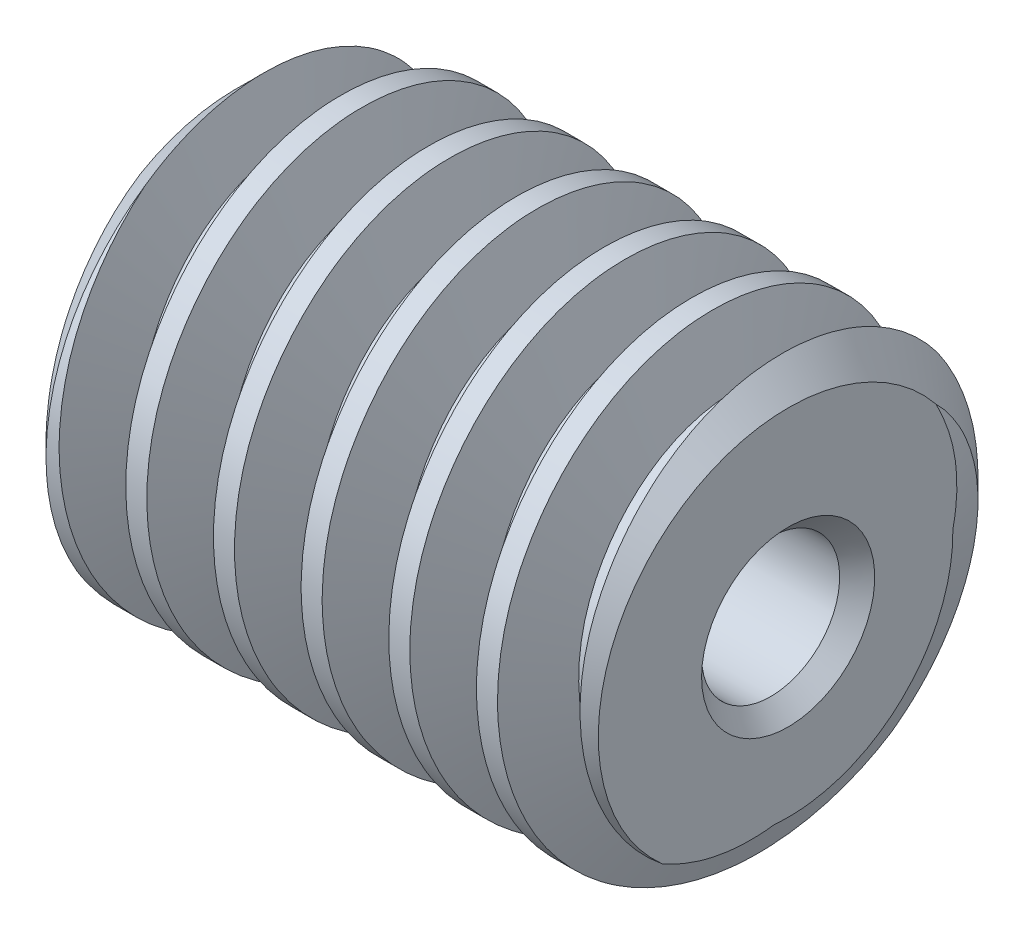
ISO-10303-21;
HEADER;
FILE_DESCRIPTION(('STEP AP214'),'2;1');
FILE_NAME('part.step','',(''),(''),'','','');
FILE_SCHEMA(('AUTOMOTIVE_DESIGN { 1 0 10303 214 1 1 1 1 }'));
ENDSEC;
DATA;
#1=APPLICATION_CONTEXT('core data for automotive mechanical design processes');
#2=APPLICATION_PROTOCOL_DEFINITION('international standard','automotive_design',2000,#1);
#3=PRODUCT_CONTEXT('',#1,'mechanical');
#4=PRODUCT('Part','Part','',(#3));
#5=PRODUCT_RELATED_PRODUCT_CATEGORY('part','',(#4));
#6=PRODUCT_DEFINITION_FORMATION('','',#4);
#7=PRODUCT_DEFINITION_CONTEXT('part definition',#1,'design');
#8=PRODUCT_DEFINITION('design','',#6,#7);
#9=PRODUCT_DEFINITION_SHAPE('','',#8);
#10=(LENGTH_UNIT() NAMED_UNIT(*) SI_UNIT(.MILLI.,.METRE.));
#11=(NAMED_UNIT(*) PLANE_ANGLE_UNIT() SI_UNIT($,.RADIAN.));
#12=(NAMED_UNIT(*) SI_UNIT($,.STERADIAN.) SOLID_ANGLE_UNIT());
#13=UNCERTAINTY_MEASURE_WITH_UNIT(LENGTH_MEASURE(1.E-05),#10,'distance_accuracy_value','');
#14=(GEOMETRIC_REPRESENTATION_CONTEXT(3) GLOBAL_UNCERTAINTY_ASSIGNED_CONTEXT((#13)) GLOBAL_UNIT_ASSIGNED_CONTEXT((#10,
#11,#12)) REPRESENTATION_CONTEXT('',''));
#15=CARTESIAN_POINT('',(0.,0.,0.));
#16=DIRECTION('',(0.,0.,1.));
#17=DIRECTION('',(1.,0.,0.));
#18=AXIS2_PLACEMENT_3D('',#15,#16,#17);
#19=CARTESIAN_POINT('',(-4.,0.627,0.));
#20=DIRECTION('',(1.,0.,0.));
#21=DIRECTION('',(0.,0.,-1.));
#22=AXIS2_PLACEMENT_3D('',#19,#20,#21);
#23=PLANE('',#22);
#24=CARTESIAN_POINT('',(-4.,0.,0.));
#25=DIRECTION('',(-1.,0.,0.));
#26=DIRECTION('',(0.,0.,1.));
#27=AXIS2_PLACEMENT_3D('',#24,#25,#26);
#28=CIRCLE('',#27,0.627);
#29=CARTESIAN_POINT('',(-4.,0.,0.627));
#30=VERTEX_POINT('',#29);
#31=EDGE_CURVE('E229',#30,#30,#28,.T.);
#32=ORIENTED_EDGE('',*,*,#31,.F.);
#33=EDGE_LOOP('',(#32));
#34=FACE_BOUND('',#33,.T.);
#35=CARTESIAN_POINT('',(-4.,-1.13917680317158,0.354968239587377));
#36=CARTESIAN_POINT('',(-4.,-1.15526091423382,0.32786256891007));
#37=CARTESIAN_POINT('',(-4.,-1.17018548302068,0.300072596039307));
#38=CARTESIAN_POINT('',(-4.,-1.19761712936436,0.243362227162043));
#39=CARTESIAN_POINT('',(-4.,-1.21012689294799,0.214443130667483));
#40=CARTESIAN_POINT('',(-4.,-1.23262511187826,0.1557600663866));
#41=CARTESIAN_POINT('',(-4.,-1.24262273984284,0.125999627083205));
#42=CARTESIAN_POINT('',(-4.,-1.25573865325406,0.0808163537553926));
#43=CARTESIAN_POINT('',(-4.,-1.25979803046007,0.0656607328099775));
#44=CARTESIAN_POINT('',(-4.,-1.26726931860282,0.0351891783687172));
#45=CARTESIAN_POINT('',(-4.,-1.2706811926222,0.0198732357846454));
#46=CARTESIAN_POINT('',(-4.,-1.27767550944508,-0.0146234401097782));
#47=CARTESIAN_POINT('',(-4.,-1.28109696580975,-0.0338365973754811));
#48=CARTESIAN_POINT('',(-4.,-1.28716126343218,-0.0723848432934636));
#49=CARTESIAN_POINT('',(-4.,-1.28980404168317,-0.0917199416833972));
#50=CARTESIAN_POINT('',(-4.,-1.29650515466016,-0.149876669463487));
#51=CARTESIAN_POINT('',(-4.,-1.29933580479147,-0.188847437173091));
#52=CARTESIAN_POINT('',(-4.,-1.3017190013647,-0.266978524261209));
#53=CARTESIAN_POINT('',(-4.,-1.30126376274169,-0.306139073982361));
#54=CARTESIAN_POINT('',(-4.,-1.29705524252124,-0.384263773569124));
#55=CARTESIAN_POINT('',(-4.,-1.29330279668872,-0.423227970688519));
#56=CARTESIAN_POINT('',(-4.,-1.27713278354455,-0.539373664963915));
#57=CARTESIAN_POINT('',(-4.,-1.25980618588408,-0.615931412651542));
#58=CARTESIAN_POINT('',(-4.,-1.21259291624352,-0.76494835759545));
#59=CARTESIAN_POINT('',(-4.,-1.1827177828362,-0.83741125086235));
#60=CARTESIAN_POINT('',(-4.,-1.11120312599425,-0.976566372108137));
#61=CARTESIAN_POINT('',(-4.,-1.06952634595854,-1.04323943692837));
#62=CARTESIAN_POINT('',(-4.,-0.975664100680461,-1.16870134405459));
#63=CARTESIAN_POINT('',(-4.00000000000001,-0.923486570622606,-1.22749608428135));
#64=CARTESIAN_POINT('',(-4.,-0.846363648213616,-1.3011384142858));
#65=CARTESIAN_POINT('',(-4.,-0.825248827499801,-1.32011898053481));
#66=CARTESIAN_POINT('',(-4.,-0.792766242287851,-1.34758640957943));
#67=CARTESIAN_POINT('',(-4.,-0.781815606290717,-1.35656605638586));
#68=CARTESIAN_POINT('',(-4.,-0.759682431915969,-1.374238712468));
#69=CARTESIAN_POINT('',(-4.,-0.748499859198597,-1.38293167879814));
#70=CARTESIAN_POINT('',(-4.,-0.737225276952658,-1.3915));
#71=B_SPLINE_CURVE_WITH_KNOTS('',3,(#35,#36,#37,#38,#39,#40,#41,#42,#43,#44,#45,#46,#47,#48,#49,
#50,#51,#52,#53,#54,#55,#56,#57,#58,#59,#60,#61,#62,#63,#64,#65,#66,#67,#68,#69,#70),
.UNSPECIFIED.,.F.,.F.,(4,2,2,2,2,2,2,2,2,2,2,2,2,2,2,2,2,4),(0.,0.0945214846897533,
0.188937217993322,0.28300302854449,0.330060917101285,0.377121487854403,0.435648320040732,
0.494179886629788,0.611250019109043,0.728597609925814,0.845915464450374,1.0801862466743,
1.31424208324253,1.5490452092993,1.78367156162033,1.86880853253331,1.91128768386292,
1.95377317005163),.UNSPECIFIED.);
#72=CARTESIAN_POINT('',(-4.,-1.13917680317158,0.354968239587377));
#73=VERTEX_POINT('',#72);
#74=CARTESIAN_POINT('',(-4.,-1.28298009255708,-0.494557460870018));
#75=VERTEX_POINT('',#74);
#76=EDGE_CURVE('E65',#73,#75,#71,.T.);
#77=ORIENTED_EDGE('',*,*,#76,.F.);
#78=CARTESIAN_POINT('',(-4.,0.441814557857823,1.10838898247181));
#79=CARTESIAN_POINT('',(-3.99999999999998,0.388979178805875,1.12948048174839));
#80=CARTESIAN_POINT('',(-3.99999999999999,0.3346247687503,1.14673728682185));
#81=CARTESIAN_POINT('',(-4.00000000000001,0.224055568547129,1.17334488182));
#82=CARTESIAN_POINT('',(-4.00000000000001,0.167842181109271,1.18270149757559));
#83=CARTESIAN_POINT('',(-3.99999999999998,0.0546405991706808,1.19330489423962));
#84=CARTESIAN_POINT('',(-3.99999999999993,-0.00234774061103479,1.1945501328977));
#85=CARTESIAN_POINT('',(-4.00000000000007,-0.115926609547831,1.18891711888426));
#86=CARTESIAN_POINT('',(-4.00000000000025,-0.17251698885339,1.18203595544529));
#87=CARTESIAN_POINT('',(-4.00000000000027,-0.294189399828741,1.15830394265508));
#88=CARTESIAN_POINT('',(-4.00000000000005,-0.358977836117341,1.13988875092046));
#89=CARTESIAN_POINT('',(-3.99999999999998,-0.453079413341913,1.10434393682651));
#90=CARTESIAN_POINT('',(-3.99999999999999,-0.483945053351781,1.09116833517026));
#91=CARTESIAN_POINT('',(-4.00000000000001,-0.544488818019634,1.06225422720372));
#92=CARTESIAN_POINT('',(-4.,-0.574165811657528,1.04651334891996));
#93=CARTESIAN_POINT('',(-3.99999999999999,-0.660992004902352,0.995643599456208));
#94=CARTESIAN_POINT('',(-4.,-0.716034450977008,0.956830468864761));
#95=CARTESIAN_POINT('',(-4.,-0.818810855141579,0.870504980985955));
#96=CARTESIAN_POINT('',(-4.,-0.866544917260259,0.822992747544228));
#97=CARTESIAN_POINT('',(-4.,-0.931659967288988,0.746235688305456));
#98=CARTESIAN_POINT('',(-4.,-0.952304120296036,0.719701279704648));
#99=CARTESIAN_POINT('',(-4.,-0.991266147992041,0.665015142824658));
#100=CARTESIAN_POINT('',(-4.,-1.00958601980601,0.63686483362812));
#101=CARTESIAN_POINT('',(-4.,-1.0608227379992,0.550323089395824));
#102=CARTESIAN_POINT('',(-4.,-1.09012380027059,0.489714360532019));
#103=CARTESIAN_POINT('',(-4.,-1.12324817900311,0.403359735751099));
#104=CARTESIAN_POINT('',(-4.,-1.13160979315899,0.379276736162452));
#105=CARTESIAN_POINT('',(-4.,-1.13917680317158,0.354968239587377));
#106=B_SPLINE_CURVE_WITH_KNOTS('',3,(#78,#79,#80,#81,#82,#83,#84,#85,#86,#87,#88,#89,#90,#91,
#92,#93,#94,#95,#96,#97,#98,#99,#100,#101,#102,#103,#104,#105),.UNSPECIFIED.,.F.,.F.,(4,2,2,2,2,
2,2,2,2,2,2,2,2,4),(0.,0.170508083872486,0.34089032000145,0.511304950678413,0.681780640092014,
0.882777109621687,0.98335742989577,1.08403128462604,1.28506853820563,1.48610292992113,
1.5868538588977,1.68751762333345,1.88835400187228,1.96477230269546),.UNSPECIFIED.);
#107=CARTESIAN_POINT('',(-4.,0.441814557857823,1.10838898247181));
#108=VERTEX_POINT('',#107);
#109=EDGE_CURVE('E106',#108,#73,#106,.T.);
#110=ORIENTED_EDGE('',*,*,#109,.F.);
#111=CARTESIAN_POINT('',(-4.,1.39149999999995,0.397007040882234));
#112=CARTESIAN_POINT('',(-4.,1.37422737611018,0.430975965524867));
#113=CARTESIAN_POINT('',(-4.,1.35553322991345,0.46420381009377));
#114=CARTESIAN_POINT('',(-4.,1.3154182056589,0.528968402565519));
#115=CARTESIAN_POINT('',(-4.,1.29399744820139,0.560505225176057));
#116=CARTESIAN_POINT('',(-4.,1.22580911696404,0.652281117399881));
#117=CARTESIAN_POINT('',(-4.,1.17512172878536,0.709673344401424));
#118=CARTESIAN_POINT('',(-4.,1.06484448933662,0.814963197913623));
#119=CARTESIAN_POINT('',(-4.,1.00526900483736,0.862875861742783));
#120=CARTESIAN_POINT('',(-4.,0.910601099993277,0.926613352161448));
#121=CARTESIAN_POINT('',(-4.,0.878175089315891,0.946497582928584));
#122=CARTESIAN_POINT('',(-4.,0.811745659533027,0.983459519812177));
#123=CARTESIAN_POINT('',(-4.,0.777742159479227,1.00053708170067));
#124=CARTESIAN_POINT('',(-4.,0.719071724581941,1.02696286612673));
#125=CARTESIAN_POINT('',(-4.,0.694744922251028,1.03707405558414));
#126=CARTESIAN_POINT('',(-4.,0.657851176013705,1.05115708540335));
#127=CARTESIAN_POINT('',(-4.,0.645489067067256,1.05566983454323));
#128=CARTESIAN_POINT('',(-4.,0.620640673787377,1.06433863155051));
#129=CARTESIAN_POINT('',(-4.,0.608154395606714,1.0684946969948));
#130=CARTESIAN_POINT('',(-4.,0.570472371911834,1.08027212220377));
#131=CARTESIAN_POINT('',(-4.,0.545056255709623,1.08720159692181));
#132=CARTESIAN_POINT('',(-4.,0.493746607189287,1.0992018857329));
#133=CARTESIAN_POINT('',(-4.,0.467852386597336,1.10426975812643));
#134=CARTESIAN_POINT('',(-4.,0.441814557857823,1.10838898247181));
#135=B_SPLINE_CURVE_WITH_KNOTS('',3,(#111,#112,#113,#114,#115,#116,#117,#118,#119,#120,#121,
#122,#123,#124,#125,#126,#127,#128,#129,#130,#131,#132,#133,#134),.UNSPECIFIED.,.F.,.F.,(4,2,2,
2,2,2,2,2,2,2,2,4),(0.,0.114258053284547,0.228511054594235,0.457057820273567,0.685239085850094,
0.799238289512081,0.913243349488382,0.992232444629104,1.03170774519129,1.07118109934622,
1.15013687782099,1.22921689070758),.UNSPECIFIED.);
#136=CARTESIAN_POINT('',(-4.,1.18768146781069,0.692847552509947));
#137=VERTEX_POINT('',#136);
#138=EDGE_CURVE('E93',#137,#108,#135,.T.);
#139=ORIENTED_EDGE('',*,*,#138,.F.);
#140=CARTESIAN_POINT('',(-4.,0.,0.));
#141=DIRECTION('',(-1.,0.,0.));
#142=DIRECTION('',(0.,0.,1.));
#143=AXIS2_PLACEMENT_3D('',#140,#141,#142);
#144=CIRCLE('',#143,1.37499999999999);
#145=EDGE_CURVE('E231',#137,#75,#144,.T.);
#146=ORIENTED_EDGE('',*,*,#145,.T.);
#147=EDGE_LOOP('',(#77,#110,#139,#146));
#148=FACE_BOUND('',#147,.T.);
#149=ADVANCED_FACE('F36',(#34,#148),#23,.F.);
#150=CARTESIAN_POINT('',(-3.75,0.,0.));
#151=DIRECTION('',(1.,0.,0.));
#152=DIRECTION('',(0.,0.,-1.));
#153=AXIS2_PLACEMENT_3D('',#150,#151,#152);
#154=CONICAL_SURFACE('',#153,1.62499999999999,0.785398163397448);
#155=CARTESIAN_POINT('',(-4.,-1.28298009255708,-0.494557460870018));
#156=CARTESIAN_POINT('',(-3.99782706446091,-1.27098904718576,-0.531707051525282));
#157=CARTESIAN_POINT('',(-3.99564593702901,-1.25743112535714,-0.568332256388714));
#158=CARTESIAN_POINT('',(-3.99128107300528,-1.22727550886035,-0.640305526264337));
#159=CARTESIAN_POINT('',(-3.98909733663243,-1.21067805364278,-0.675653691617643));
#160=CARTESIAN_POINT('',(-3.98257238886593,-1.15654735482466,-0.779289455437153));
#161=CARTESIAN_POINT('',(-3.97824730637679,-1.11461966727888,-0.84534147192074));
#162=CARTESIAN_POINT('',(-3.96976209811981,-1.02020375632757,-0.969508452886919));
#163=CARTESIAN_POINT('',(-3.96560210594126,-0.967707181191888,-1.02761707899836));
#164=CARTESIAN_POINT('',(-3.95957028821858,-0.882263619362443,-1.1075086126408));
#165=CARTESIAN_POINT('',(-3.95759366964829,-0.852653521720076,-1.13293545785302));
#166=CARTESIAN_POINT('',(-3.95372297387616,-0.791378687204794,-1.18121261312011));
#167=CARTESIAN_POINT('',(-3.95182889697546,-0.759713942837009,-1.20406291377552));
#168=CARTESIAN_POINT('',(-3.94905159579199,-0.710904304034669,-1.23625340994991));
#169=CARTESIAN_POINT('',(-3.94813730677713,-0.694432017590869,-1.24662717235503));
#170=CARTESIAN_POINT('',(-3.94628235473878,-0.661091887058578,-1.26671602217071));
#171=CARTESIAN_POINT('',(-3.94534169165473,-0.644224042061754,-1.27643110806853));
#172=CARTESIAN_POINT('',(-3.94249652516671,-0.593059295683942,-1.30455267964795));
#173=CARTESIAN_POINT('',(-3.94056855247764,-0.558195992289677,-1.32193889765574));
#174=CARTESIAN_POINT('',(-3.93665640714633,-0.487181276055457,-1.35388299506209));
#175=CARTESIAN_POINT('',(-3.93467220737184,-0.451029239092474,-1.36843948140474));
#176=CARTESIAN_POINT('',(-3.93066470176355,-0.37769134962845,-1.39462101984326));
#177=CARTESIAN_POINT('',(-3.92864139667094,-0.340505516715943,-1.4062461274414));
#178=CARTESIAN_POINT('',(-3.9223068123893,-0.223579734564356,-1.43772220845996));
#179=CARTESIAN_POINT('',(-3.91794647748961,-0.14237929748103,-1.4523991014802));
#180=CARTESIAN_POINT('',(-3.90923811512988,0.021277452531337,-1.46790640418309));
#181=CARTESIAN_POINT('',(-3.90489008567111,0.103733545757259,-1.46873920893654));
#182=CARTESIAN_POINT('',(-3.89631227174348,0.267800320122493,-1.45655909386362));
#183=CARTESIAN_POINT('',(-3.89208276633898,0.34940876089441,-1.44351592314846));
#184=CARTESIAN_POINT('',(-3.88386330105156,0.50933565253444,-1.40386090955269));
#185=CARTESIAN_POINT('',(-3.87987333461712,0.587654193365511,-1.37724943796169));
#186=CARTESIAN_POINT('',(-3.87509879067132,0.681930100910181,-1.33607620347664));
#187=CARTESIAN_POINT('',(-3.87415479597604,0.700598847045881,-1.32744880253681));
#188=CARTESIAN_POINT('',(-3.87229502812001,0.737554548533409,-1.30941078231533));
#189=CARTESIAN_POINT('',(-3.87137925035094,0.755841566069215,-1.30000029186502));
#190=CARTESIAN_POINT('',(-3.86860184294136,0.810118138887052,-1.270681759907));
#191=CARTESIAN_POINT('',(-3.86671007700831,0.845524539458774,-1.24968607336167));
#192=CARTESIAN_POINT('',(-3.86286319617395,0.914552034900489,-1.20492348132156));
#193=CARTESIAN_POINT('',(-3.86090806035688,0.948172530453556,-1.1811556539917));
#194=CARTESIAN_POINT('',(-3.85694859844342,1.01339482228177,-1.13101794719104));
#195=CARTESIAN_POINT('',(-3.85494427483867,1.04499672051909,-1.10464819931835));
#196=CARTESIAN_POINT('',(-3.84870521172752,1.13907421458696,-1.01951111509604));
#197=CARTESIAN_POINT('',(-3.84440727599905,1.19789389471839,-0.956603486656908));
#198=CARTESIAN_POINT('',(-3.83578327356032,1.30421065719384,-0.821936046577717));
#199=CARTESIAN_POINT('',(-3.83145720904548,1.35170861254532,-0.750176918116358));
#200=CARTESIAN_POINT('',(-3.82284223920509,1.43458744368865,-0.598865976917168));
#201=CARTESIAN_POINT('',(-3.81855427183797,1.46982871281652,-0.519236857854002));
#202=CARTESIAN_POINT('',(-3.81227982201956,1.51225921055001,-0.396297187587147));
#203=CARTESIAN_POINT('',(-3.81021387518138,1.52466672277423,-0.354719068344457));
#204=CARTESIAN_POINT('',(-3.80614606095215,1.54593700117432,-0.270655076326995));
#205=CARTESIAN_POINT('',(-3.80414418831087,1.55480005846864,-0.228169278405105));
#206=CARTESIAN_POINT('',(-3.80021809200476,1.56890441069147,-0.142650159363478));
#207=CARTESIAN_POINT('',(-3.79829377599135,1.5741501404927,-0.0996175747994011));
#208=CARTESIAN_POINT('',(-3.79453961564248,1.58099766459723,-0.0132687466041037));
#209=CARTESIAN_POINT('',(-3.79270978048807,1.58259910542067,0.0300475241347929));
#210=CARTESIAN_POINT('',(-3.78708587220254,1.58219562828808,0.160032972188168));
#211=CARTESIAN_POINT('',(-3.78315742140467,1.57498280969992,0.246738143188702));
#212=CARTESIAN_POINT('',(-3.77500738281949,1.54631119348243,0.420603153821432));
#213=CARTESIAN_POINT('',(-3.77078041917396,1.52439762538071,0.50768641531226));
#214=CARTESIAN_POINT('',(-3.76225848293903,1.46652430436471,0.676891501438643));
#215=CARTESIAN_POINT('',(-3.75796368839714,1.43059685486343,0.759024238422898));
#216=CARTESIAN_POINT('',(-3.75246246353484,1.37592904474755,0.860303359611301));
#217=CARTESIAN_POINT('',(-3.75122917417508,1.36310669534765,0.882751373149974));
#218=CARTESIAN_POINT('',(-3.75000000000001,1.34975583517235,0.904866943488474));
#219=B_SPLINE_CURVE_WITH_KNOTS('',3,(#155,#156,#157,#158,#159,#160,#161,#162,#163,#164,#165,
#166,#167,#168,#169,#170,#171,#172,#173,#174,#175,#176,#177,#178,#179,#180,#181,#182,#183,#184,
#185,#186,#187,#188,#189,#190,#191,#192,#193,#194,#195,#196,#197,#198,#199,#200,#201,#202,#203,
#204,#205,#206,#207,#208,#209,#210,#211,#212,#213,#214,#215,#216,#217,#218),.UNSPECIFIED.,.F.,
.F.,(4,2,2,2,2,2,2,2,2,2,2,2,2,2,2,2,2,2,2,2,2,2,2,2,2,2,2,2,2,2,2,4),(0.,0.117222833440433,
0.234436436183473,0.468323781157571,0.7023966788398,0.819521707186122,0.936647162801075,
0.995098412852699,1.05354979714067,1.17043395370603,1.28737550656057,1.40431484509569,
1.65093369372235,1.89750987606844,2.14462472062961,2.39173280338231,2.45348596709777,
2.51522899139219,2.63871070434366,2.76223359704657,2.88575024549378,3.14312284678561,
3.40047559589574,3.66067039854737,3.79086136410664,3.9210416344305,4.05106201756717,
4.18109501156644,4.44116292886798,4.70967162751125,4.97756500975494,5.05517637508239),.UNSPECIFIED.);
#220=CARTESIAN_POINT('',(-3.75000000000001,1.34975583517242,0.904866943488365));
#221=VERTEX_POINT('',#220);
#222=EDGE_CURVE('E117',#75,#221,#219,.T.);
#223=ORIENTED_EDGE('',*,*,#222,.F.);
#224=ORIENTED_EDGE('',*,*,#145,.F.);
#225=CARTESIAN_POINT('',(-3.75,-0.823708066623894,1.40076051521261));
#226=CARTESIAN_POINT('',(-3.7538423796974,-0.784268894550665,1.41949473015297));
#227=CARTESIAN_POINT('',(-3.75778378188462,-0.744060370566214,1.43654007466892));
#228=CARTESIAN_POINT('',(-3.76584941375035,-0.662359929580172,1.46715148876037));
#229=CARTESIAN_POINT('',(-3.76997363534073,-0.620868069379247,1.48071771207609));
#230=CARTESIAN_POINT('',(-3.78258006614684,-0.495026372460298,1.51599685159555));
#231=CARTESIAN_POINT('',(-3.79131275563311,-0.40913801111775,1.5323719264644));
#232=CARTESIAN_POINT('',(-3.8092128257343,-0.236073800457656,1.55030399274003));
#233=CARTESIAN_POINT('',(-3.8183793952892,-0.148900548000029,1.55188761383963));
#234=CARTESIAN_POINT('',(-3.83693884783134,0.0244362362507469,1.54029022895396));
#235=CARTESIAN_POINT('',(-3.84633173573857,0.110599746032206,1.52710890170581));
#236=CARTESIAN_POINT('',(-3.86506736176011,0.279242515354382,1.48638053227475));
#237=CARTESIAN_POINT('',(-3.87441016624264,0.361731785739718,1.45887549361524));
#238=CARTESIAN_POINT('',(-3.88817320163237,0.481062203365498,1.40751447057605));
#239=CARTESIAN_POINT('',(-3.89272177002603,0.52012802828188,1.38869535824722));
#240=CARTESIAN_POINT('',(-3.90171706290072,0.596541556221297,1.34779707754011));
#241=CARTESIAN_POINT('',(-3.90616377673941,0.633889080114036,1.32571757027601));
#242=CARTESIAN_POINT('',(-3.9148703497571,0.706802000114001,1.27839236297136));
#243=CARTESIAN_POINT('',(-3.91912923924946,0.74235825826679,1.25313235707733));
#244=CARTESIAN_POINT('',(-3.92791455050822,0.810872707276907,1.19934156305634));
#245=CARTESIAN_POINT('',(-3.932440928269,0.843831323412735,1.17081131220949));
#246=CARTESIAN_POINT('',(-3.9416919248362,0.906819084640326,1.11081858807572));
#247=CARTESIAN_POINT('',(-3.94641619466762,0.936853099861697,1.07936116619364));
#248=CARTESIAN_POINT('',(-3.95604663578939,0.993776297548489,1.01375566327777));
#249=CARTESIAN_POINT('',(-3.96095277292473,1.0206660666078,0.979608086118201));
#250=CARTESIAN_POINT('',(-3.97146440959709,1.07386102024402,0.905001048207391));
#251=CARTESIAN_POINT('',(-3.97708715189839,1.09977105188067,0.864261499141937));
#252=CARTESIAN_POINT('',(-3.98846047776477,1.14713513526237,0.780301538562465));
#253=CARTESIAN_POINT('',(-3.99421102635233,1.16859038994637,0.737081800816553));
#254=CARTESIAN_POINT('',(-3.99999999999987,1.18768146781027,0.692847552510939));
#255=B_SPLINE_CURVE_WITH_KNOTS('',3,(#225,#226,#227,#228,#229,#230,#231,#232,#233,#234,#235,
#236,#237,#238,#239,#240,#241,#242,#243,#244,#245,#246,#247,#248,#249,#250,#251,#252,#253,#254),
.UNSPECIFIED.,.F.,.F.,(4,2,2,2,2,2,2,2,2,2,2,2,2,2,4),(0.,0.131412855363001,0.262819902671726,
0.525066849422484,0.786841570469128,1.04862198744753,1.30963903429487,1.44031026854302,
1.57099509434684,1.7022902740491,1.83356391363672,1.96461507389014,2.09564174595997,
2.24119147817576,2.38670185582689),.UNSPECIFIED.);
#256=CARTESIAN_POINT('',(-3.75,-0.823708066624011,1.40076051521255));
#257=VERTEX_POINT('',#256);
#258=EDGE_CURVE('E96',#257,#137,#255,.T.);
#259=ORIENTED_EDGE('',*,*,#258,.F.);
#260=CARTESIAN_POINT('',(-3.75,0.,0.));
#261=DIRECTION('',(-1.,0.,0.));
#262=DIRECTION('',(0.,0.,1.));
#263=AXIS2_PLACEMENT_3D('',#260,#261,#262);
#264=CIRCLE('',#263,1.62499999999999);
#265=EDGE_CURVE('E232',#257,#221,#264,.T.);
#266=ORIENTED_EDGE('',*,*,#265,.T.);
#267=EDGE_LOOP('',(#223,#224,#259,#266));
#268=FACE_BOUND('',#267,.T.);
#269=ADVANCED_FACE('F198',(#268),#154,.T.);
#270=CARTESIAN_POINT('',(-53.110333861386,0.,0.));
#271=DIRECTION('',(-1.,0.,0.));
#272=DIRECTION('',(0.,0.,1.));
#273=AXIS2_PLACEMENT_3D('',#270,#271,#272);
#274=CYLINDRICAL_SURFACE('',#273,1.62499999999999);
#275=CARTESIAN_POINT('',(0.4826,1.62499999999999,0.));
#276=CARTESIAN_POINT('',(0.429683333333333,1.62499999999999,-0.938194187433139));
#277=CARTESIAN_POINT('',(0.376766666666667,0.812499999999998,-1.40729128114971));
#278=CARTESIAN_POINT('',(0.32385,0.,-1.87638837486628));
#279=CARTESIAN_POINT('',(0.270933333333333,-0.812499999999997,-1.40729128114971));
#280=CARTESIAN_POINT('',(0.218016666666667,-1.62499999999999,-0.938194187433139));
#281=CARTESIAN_POINT('',(0.1651,-1.62499999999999,0.));
#282=CARTESIAN_POINT('',(0.112183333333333,-1.625,0.938194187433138));
#283=CARTESIAN_POINT('',(0.0592666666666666,-0.812499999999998,1.40729128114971));
#284=CARTESIAN_POINT('',(0.00634999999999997,0.,1.87638837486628));
#285=CARTESIAN_POINT('',(-0.0465666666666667,0.812499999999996,1.40729128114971));
#286=CARTESIAN_POINT('',(-0.0994833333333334,1.62499999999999,0.93819418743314));
#287=CARTESIAN_POINT('',(-0.1524,1.62499999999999,0.));
#288=CARTESIAN_POINT('',(-0.205316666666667,1.62499999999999,-0.938194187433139));
#289=CARTESIAN_POINT('',(-0.258233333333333,0.812499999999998,-1.40729128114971));
#290=CARTESIAN_POINT('',(-0.31115,0.,-1.87638837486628));
#291=CARTESIAN_POINT('',(-0.364066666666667,-0.812499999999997,-1.40729128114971));
#292=CARTESIAN_POINT('',(-0.416983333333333,-1.62499999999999,-0.938194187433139));
#293=CARTESIAN_POINT('',(-0.4699,-1.62499999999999,0.));
#294=CARTESIAN_POINT('',(-0.522816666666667,-1.625,0.938194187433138));
#295=CARTESIAN_POINT('',(-0.575733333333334,-0.812499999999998,1.40729128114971));
#296=CARTESIAN_POINT('',(-0.62865,0.,1.87638837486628));
#297=CARTESIAN_POINT('',(-0.681566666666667,0.812499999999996,1.40729128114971));
#298=CARTESIAN_POINT('',(-0.734483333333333,1.62499999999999,0.93819418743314));
#299=CARTESIAN_POINT('',(-0.7874,1.62499999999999,0.));
#300=CARTESIAN_POINT('',(-0.840316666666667,1.62499999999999,-0.938194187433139));
#301=CARTESIAN_POINT('',(-0.893233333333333,0.812499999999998,-1.40729128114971));
#302=CARTESIAN_POINT('',(-0.94615,0.,-1.87638837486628));
#303=CARTESIAN_POINT('',(-0.999066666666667,-0.812499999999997,-1.40729128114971));
#304=CARTESIAN_POINT('',(-1.05198333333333,-1.62499999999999,-0.938194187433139));
#305=CARTESIAN_POINT('',(-1.1049,-1.62499999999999,0.));
#306=CARTESIAN_POINT('',(-1.15781666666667,-1.625,0.938194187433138));
#307=CARTESIAN_POINT('',(-1.21073333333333,-0.812499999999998,1.40729128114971));
#308=CARTESIAN_POINT('',(-1.26365,0.,1.87638837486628));
#309=CARTESIAN_POINT('',(-1.31656666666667,0.812499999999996,1.40729128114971));
#310=CARTESIAN_POINT('',(-1.36948333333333,1.62499999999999,0.93819418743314));
#311=CARTESIAN_POINT('',(-1.4224,1.62499999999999,0.));
#312=CARTESIAN_POINT('',(-1.47531666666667,1.62499999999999,-0.938194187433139));
#313=CARTESIAN_POINT('',(-1.52823333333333,0.812499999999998,-1.40729128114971));
#314=CARTESIAN_POINT('',(-1.58115,0.,-1.87638837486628));
#315=CARTESIAN_POINT('',(-1.63406666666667,-0.812499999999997,-1.40729128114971));
#316=CARTESIAN_POINT('',(-1.68698333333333,-1.62499999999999,-0.938194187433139));
#317=CARTESIAN_POINT('',(-1.7399,-1.62499999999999,0.));
#318=CARTESIAN_POINT('',(-1.79281666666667,-1.625,0.938194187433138));
#319=CARTESIAN_POINT('',(-1.84573333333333,-0.812499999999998,1.40729128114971));
#320=CARTESIAN_POINT('',(-1.89865,0.,1.87638837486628));
#321=CARTESIAN_POINT('',(-1.95156666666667,0.812499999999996,1.40729128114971));
#322=CARTESIAN_POINT('',(-2.00448333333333,1.62499999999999,0.93819418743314));
#323=CARTESIAN_POINT('',(-2.0574,1.62499999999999,0.));
#324=CARTESIAN_POINT('',(-2.11031666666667,1.62499999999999,-0.938194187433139));
#325=CARTESIAN_POINT('',(-2.16323333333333,0.812499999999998,-1.40729128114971));
#326=CARTESIAN_POINT('',(-2.21615,0.,-1.87638837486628));
#327=CARTESIAN_POINT('',(-2.26906666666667,-0.812499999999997,-1.40729128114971));
#328=CARTESIAN_POINT('',(-2.32198333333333,-1.62499999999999,-0.938194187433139));
#329=CARTESIAN_POINT('',(-2.3749,-1.62499999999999,0.));
#330=CARTESIAN_POINT('',(-2.42781666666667,-1.625,0.938194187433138));
#331=CARTESIAN_POINT('',(-2.48073333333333,-0.812499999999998,1.40729128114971));
#332=CARTESIAN_POINT('',(-2.53365,0.,1.87638837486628));
#333=CARTESIAN_POINT('',(-2.58656666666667,0.812499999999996,1.40729128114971));
#334=CARTESIAN_POINT('',(-2.63948333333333,1.62499999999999,0.93819418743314));
#335=CARTESIAN_POINT('',(-2.6924,1.62499999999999,0.));
#336=CARTESIAN_POINT('',(-2.74531666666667,1.62499999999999,-0.938194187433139));
#337=CARTESIAN_POINT('',(-2.79823333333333,0.812499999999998,-1.40729128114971));
#338=CARTESIAN_POINT('',(-2.85115,0.,-1.87638837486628));
#339=CARTESIAN_POINT('',(-2.90406666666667,-0.812499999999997,-1.40729128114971));
#340=CARTESIAN_POINT('',(-2.95698333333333,-1.62499999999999,-0.938194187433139));
#341=CARTESIAN_POINT('',(-3.0099,-1.62499999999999,0.));
#342=CARTESIAN_POINT('',(-3.06281666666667,-1.625,0.938194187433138));
#343=CARTESIAN_POINT('',(-3.11573333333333,-0.812499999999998,1.40729128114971));
#344=CARTESIAN_POINT('',(-3.16865,0.,1.87638837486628));
#345=CARTESIAN_POINT('',(-3.22156666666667,0.812499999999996,1.40729128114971));
#346=CARTESIAN_POINT('',(-3.27448333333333,1.62499999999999,0.93819418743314));
#347=CARTESIAN_POINT('',(-3.3274,1.62499999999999,0.));
#348=CARTESIAN_POINT('',(-3.38031666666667,1.62499999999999,-0.938194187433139));
#349=CARTESIAN_POINT('',(-3.43323333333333,0.812499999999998,-1.40729128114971));
#350=CARTESIAN_POINT('',(-3.48615,0.,-1.87638837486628));
#351=CARTESIAN_POINT('',(-3.53906666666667,-0.812499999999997,-1.40729128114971));
#352=CARTESIAN_POINT('',(-3.59198333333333,-1.62499999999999,-0.938194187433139));
#353=CARTESIAN_POINT('',(-3.6449,-1.62499999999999,0.));
#354=CARTESIAN_POINT('',(-3.69781666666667,-1.625,0.938194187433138));
#355=CARTESIAN_POINT('',(-3.75073333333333,-0.812499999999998,1.40729128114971));
#356=CARTESIAN_POINT('',(-3.80365,0.,1.87638837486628));
#357=CARTESIAN_POINT('',(-3.85656666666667,0.812499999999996,1.40729128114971));
#358=CARTESIAN_POINT('',(-3.90948333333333,1.62499999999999,0.93819418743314));
#359=CARTESIAN_POINT('',(-3.9624,1.62499999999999,0.));
#360=(BOUNDED_CURVE() B_SPLINE_CURVE(2,(#275,#276,#277,#278,#279,#280,#281,#282,#283,#284,#285,
#286,#287,#288,#289,#290,#291,#292,#293,#294,#295,#296,#297,#298,#299,#300,#301,#302,#303,#304,
#305,#306,#307,#308,#309,#310,#311,#312,#313,#314,#315,#316,#317,#318,#319,#320,#321,#322,#323,
#324,#325,#326,#327,#328,#329,#330,#331,#332,#333,#334,#335,#336,#337,#338,#339,#340,#341,#342,
#343,#344,#345,#346,#347,#348,#349,#350,#351,#352,#353,#354,#355,#356,#357,#358,#359),
.UNSPECIFIED.,.F.,.F.) B_SPLINE_CURVE_WITH_KNOTS((3,2,2,2,2,2,2,2,2,2,2,2,2,2,2,2,2,2,2,2,2,2,2,
2,2,2,2,2,2,2,2,2,2,2,2,2,2,2,2,2,2,2,3),(0.,0.0238095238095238,0.0476190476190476,
0.0714285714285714,0.0952380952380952,0.119047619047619,0.142857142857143,0.166666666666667,
0.19047619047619,0.214285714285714,0.238095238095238,0.261904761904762,0.285714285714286,
0.30952380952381,0.333333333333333,0.357142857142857,0.380952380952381,0.404761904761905,
0.428571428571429,0.452380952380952,0.476190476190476,0.5,0.523809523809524,0.547619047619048,
0.571428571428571,0.595238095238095,0.619047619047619,0.642857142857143,0.666666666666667,
0.69047619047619,0.714285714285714,0.738095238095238,0.761904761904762,0.785714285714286,
0.80952380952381,0.833333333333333,0.857142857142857,0.880952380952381,0.904761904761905,
0.928571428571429,0.952380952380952,0.976190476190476,1.),
.UNSPECIFIED.) CURVE() GEOMETRIC_REPRESENTATION_ITEM() RATIONAL_B_SPLINE_CURVE((1.,
0.866025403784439,1.,0.866025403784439,1.,0.866025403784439,1.,0.866025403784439,1.,
0.866025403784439,1.,0.866025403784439,1.,0.866025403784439,1.,0.866025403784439,1.,
0.866025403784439,1.,0.866025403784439,1.,0.866025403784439,1.,0.866025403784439,1.,
0.866025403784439,1.,0.866025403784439,1.,0.866025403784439,1.,0.866025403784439,1.,
0.866025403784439,1.,0.866025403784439,1.,0.866025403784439,1.,0.866025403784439,1.,
0.866025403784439,1.,0.866025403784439,1.,0.866025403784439,1.,0.866025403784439,1.,
0.866025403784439,1.,0.866025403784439,1.,0.866025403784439,1.,0.866025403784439,1.,
0.866025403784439,1.,0.866025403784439,1.,0.866025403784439,1.,0.866025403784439,1.,
0.866025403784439,1.,0.866025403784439,1.,0.866025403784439,1.,0.866025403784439,1.,
0.866025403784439,1.,0.866025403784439,1.,0.866025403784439,1.,0.866025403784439,1.,
0.866025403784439,1.,0.866025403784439,1.)) REPRESENTATION_ITEM(''));
#361=CARTESIAN_POINT('',(-0.25,0.932668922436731,-1.33069669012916));
#362=VERTEX_POINT('',#361);
#363=EDGE_CURVE('E110',#362,#257,#360,.T.);
#364=ORIENTED_EDGE('',*,*,#363,.F.);
#365=CARTESIAN_POINT('',(-0.25,0.,0.));
#366=DIRECTION('',(-1.,0.,0.));
#367=DIRECTION('',(0.,0.,1.));
#368=AXIS2_PLACEMENT_3D('',#365,#366,#367);
#369=CIRCLE('',#368,1.62499999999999);
#370=CARTESIAN_POINT('',(-0.250000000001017,-1.28190809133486,-0.99866743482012));
#371=VERTEX_POINT('',#370);
#372=EDGE_CURVE('E237',#362,#371,#369,.T.);
#373=ORIENTED_EDGE('',*,*,#372,.T.);
#374=CARTESIAN_POINT('',(0.,1.62499999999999,0.));
#375=CARTESIAN_POINT('',(-0.0529166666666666,1.62499999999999,-0.938194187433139));
#376=CARTESIAN_POINT('',(-0.105833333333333,0.812499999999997,-1.40729128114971));
#377=CARTESIAN_POINT('',(-0.15875,0.,-1.87638837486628));
#378=CARTESIAN_POINT('',(-0.211666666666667,-0.812499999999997,-1.40729128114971));
#379=CARTESIAN_POINT('',(-0.264583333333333,-1.62499999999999,-0.938194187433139));
#380=CARTESIAN_POINT('',(-0.3175,-1.62499999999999,0.));
#381=CARTESIAN_POINT('',(-0.370416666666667,-1.62499999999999,0.938194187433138));
#382=CARTESIAN_POINT('',(-0.423333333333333,-0.812499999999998,1.40729128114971));
#383=CARTESIAN_POINT('',(-0.47625,0.,1.87638837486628));
#384=CARTESIAN_POINT('',(-0.529166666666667,0.812499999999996,1.40729128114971));
#385=CARTESIAN_POINT('',(-0.582083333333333,1.62499999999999,0.93819418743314));
#386=CARTESIAN_POINT('',(-0.635,1.62499999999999,0.));
#387=CARTESIAN_POINT('',(-0.687916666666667,1.62499999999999,-0.938194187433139));
#388=CARTESIAN_POINT('',(-0.740833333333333,0.812499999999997,-1.40729128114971));
#389=CARTESIAN_POINT('',(-0.79375,0.,-1.87638837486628));
#390=CARTESIAN_POINT('',(-0.846666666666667,-0.812499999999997,-1.40729128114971));
#391=CARTESIAN_POINT('',(-0.899583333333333,-1.62499999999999,-0.938194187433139));
#392=CARTESIAN_POINT('',(-0.9525,-1.62499999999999,0.));
#393=CARTESIAN_POINT('',(-1.00541666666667,-1.62499999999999,0.938194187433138));
#394=CARTESIAN_POINT('',(-1.05833333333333,-0.812499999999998,1.40729128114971));
#395=CARTESIAN_POINT('',(-1.11125,0.,1.87638837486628));
#396=CARTESIAN_POINT('',(-1.16416666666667,0.812499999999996,1.40729128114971));
#397=CARTESIAN_POINT('',(-1.21708333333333,1.62499999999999,0.93819418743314));
#398=CARTESIAN_POINT('',(-1.27,1.62499999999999,0.));
#399=CARTESIAN_POINT('',(-1.32291666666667,1.62499999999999,-0.938194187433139));
#400=CARTESIAN_POINT('',(-1.37583333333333,0.812499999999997,-1.40729128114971));
#401=CARTESIAN_POINT('',(-1.42875,0.,-1.87638837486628));
#402=CARTESIAN_POINT('',(-1.48166666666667,-0.812499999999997,-1.40729128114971));
#403=CARTESIAN_POINT('',(-1.53458333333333,-1.62499999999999,-0.938194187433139));
#404=CARTESIAN_POINT('',(-1.5875,-1.62499999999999,0.));
#405=CARTESIAN_POINT('',(-1.64041666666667,-1.62499999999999,0.938194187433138));
#406=CARTESIAN_POINT('',(-1.69333333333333,-0.812499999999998,1.40729128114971));
#407=CARTESIAN_POINT('',(-1.74625,0.,1.87638837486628));
#408=CARTESIAN_POINT('',(-1.79916666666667,0.812499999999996,1.40729128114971));
#409=CARTESIAN_POINT('',(-1.85208333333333,1.62499999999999,0.93819418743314));
#410=CARTESIAN_POINT('',(-1.905,1.62499999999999,0.));
#411=CARTESIAN_POINT('',(-1.95791666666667,1.62499999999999,-0.938194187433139));
#412=CARTESIAN_POINT('',(-2.01083333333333,0.812499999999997,-1.40729128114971));
#413=CARTESIAN_POINT('',(-2.06375,0.,-1.87638837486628));
#414=CARTESIAN_POINT('',(-2.11666666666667,-0.812499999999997,-1.40729128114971));
#415=CARTESIAN_POINT('',(-2.16958333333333,-1.62499999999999,-0.938194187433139));
#416=CARTESIAN_POINT('',(-2.2225,-1.62499999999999,0.));
#417=CARTESIAN_POINT('',(-2.27541666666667,-1.62499999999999,0.938194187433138));
#418=CARTESIAN_POINT('',(-2.32833333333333,-0.812499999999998,1.40729128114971));
#419=CARTESIAN_POINT('',(-2.38125,0.,1.87638837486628));
#420=CARTESIAN_POINT('',(-2.43416666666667,0.812499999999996,1.40729128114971));
#421=CARTESIAN_POINT('',(-2.48708333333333,1.62499999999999,0.93819418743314));
#422=CARTESIAN_POINT('',(-2.54,1.62499999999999,0.));
#423=CARTESIAN_POINT('',(-2.59291666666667,1.62499999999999,-0.938194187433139));
#424=CARTESIAN_POINT('',(-2.64583333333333,0.812499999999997,-1.40729128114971));
#425=CARTESIAN_POINT('',(-2.69875,0.,-1.87638837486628));
#426=CARTESIAN_POINT('',(-2.75166666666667,-0.812499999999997,-1.40729128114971));
#427=CARTESIAN_POINT('',(-2.80458333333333,-1.62499999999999,-0.938194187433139));
#428=CARTESIAN_POINT('',(-2.8575,-1.62499999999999,0.));
#429=CARTESIAN_POINT('',(-2.91041666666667,-1.62499999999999,0.938194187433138));
#430=CARTESIAN_POINT('',(-2.96333333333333,-0.812499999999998,1.40729128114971));
#431=CARTESIAN_POINT('',(-3.01625,0.,1.87638837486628));
#432=CARTESIAN_POINT('',(-3.06916666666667,0.812499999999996,1.40729128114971));
#433=CARTESIAN_POINT('',(-3.12208333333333,1.62499999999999,0.93819418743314));
#434=CARTESIAN_POINT('',(-3.175,1.62499999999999,0.));
#435=CARTESIAN_POINT('',(-3.22791666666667,1.62499999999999,-0.938194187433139));
#436=CARTESIAN_POINT('',(-3.28083333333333,0.812499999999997,-1.40729128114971));
#437=CARTESIAN_POINT('',(-3.33375,0.,-1.87638837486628));
#438=CARTESIAN_POINT('',(-3.38666666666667,-0.812499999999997,-1.40729128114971));
#439=CARTESIAN_POINT('',(-3.43958333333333,-1.62499999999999,-0.938194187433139));
#440=CARTESIAN_POINT('',(-3.4925,-1.62499999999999,0.));
#441=CARTESIAN_POINT('',(-3.54541666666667,-1.62499999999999,0.938194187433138));
#442=CARTESIAN_POINT('',(-3.59833333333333,-0.812499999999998,1.40729128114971));
#443=CARTESIAN_POINT('',(-3.65125,0.,1.87638837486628));
#444=CARTESIAN_POINT('',(-3.70416666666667,0.812499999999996,1.40729128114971));
#445=CARTESIAN_POINT('',(-3.75708333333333,1.62499999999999,0.93819418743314));
#446=CARTESIAN_POINT('',(-3.81,1.62499999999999,0.));
#447=CARTESIAN_POINT('',(-3.86291666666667,1.62499999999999,-0.938194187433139));
#448=CARTESIAN_POINT('',(-3.91583333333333,0.812499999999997,-1.40729128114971));
#449=CARTESIAN_POINT('',(-3.96875,0.,-1.87638837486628));
#450=CARTESIAN_POINT('',(-4.02166666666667,-0.812499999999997,-1.40729128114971));
#451=CARTESIAN_POINT('',(-4.07458333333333,-1.62499999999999,-0.938194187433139));
#452=CARTESIAN_POINT('',(-4.1275,-1.62499999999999,0.));
#453=CARTESIAN_POINT('',(-4.18041666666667,-1.62499999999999,0.938194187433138));
#454=CARTESIAN_POINT('',(-4.23333333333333,-0.812499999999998,1.40729128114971));
#455=CARTESIAN_POINT('',(-4.28625,0.,1.87638837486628));
#456=CARTESIAN_POINT('',(-4.33916666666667,0.812499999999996,1.40729128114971));
#457=CARTESIAN_POINT('',(-4.39208333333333,1.62499999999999,0.93819418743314));
#458=CARTESIAN_POINT('',(-4.445,1.62499999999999,0.));
#459=(BOUNDED_CURVE() B_SPLINE_CURVE(2,(#374,#375,#376,#377,#378,#379,#380,#381,#382,#383,#384,
#385,#386,#387,#388,#389,#390,#391,#392,#393,#394,#395,#396,#397,#398,#399,#400,#401,#402,#403,
#404,#405,#406,#407,#408,#409,#410,#411,#412,#413,#414,#415,#416,#417,#418,#419,#420,#421,#422,
#423,#424,#425,#426,#427,#428,#429,#430,#431,#432,#433,#434,#435,#436,#437,#438,#439,#440,#441,
#442,#443,#444,#445,#446,#447,#448,#449,#450,#451,#452,#453,#454,#455,#456,#457,#458),
.UNSPECIFIED.,.F.,.F.) B_SPLINE_CURVE_WITH_KNOTS((3,2,2,2,2,2,2,2,2,2,2,2,2,2,2,2,2,2,2,2,2,2,2,
2,2,2,2,2,2,2,2,2,2,2,2,2,2,2,2,2,2,2,3),(0.,0.0238095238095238,0.0476190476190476,
0.0714285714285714,0.0952380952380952,0.119047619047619,0.142857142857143,0.166666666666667,
0.19047619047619,0.214285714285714,0.238095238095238,0.261904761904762,0.285714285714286,
0.30952380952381,0.333333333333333,0.357142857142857,0.380952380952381,0.404761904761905,
0.428571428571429,0.452380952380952,0.476190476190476,0.5,0.523809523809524,0.547619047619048,
0.571428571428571,0.595238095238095,0.619047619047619,0.642857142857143,0.666666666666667,
0.69047619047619,0.714285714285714,0.738095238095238,0.761904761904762,0.785714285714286,
0.80952380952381,0.833333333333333,0.857142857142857,0.880952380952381,0.904761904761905,
0.928571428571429,0.952380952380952,0.976190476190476,1.),
.UNSPECIFIED.) CURVE() GEOMETRIC_REPRESENTATION_ITEM() RATIONAL_B_SPLINE_CURVE((1.,
0.866025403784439,1.,0.866025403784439,1.,0.866025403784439,1.,0.866025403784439,1.,
0.866025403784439,1.,0.866025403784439,1.,0.866025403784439,1.,0.866025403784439,1.,
0.866025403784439,1.,0.866025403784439,1.,0.866025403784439,1.,0.866025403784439,1.,
0.866025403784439,1.,0.866025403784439,1.,0.866025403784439,1.,0.866025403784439,1.,
0.866025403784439,1.,0.866025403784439,1.,0.866025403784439,1.,0.866025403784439,1.,
0.866025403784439,1.,0.866025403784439,1.,0.866025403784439,1.,0.866025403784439,1.,
0.866025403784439,1.,0.866025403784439,1.,0.866025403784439,1.,0.866025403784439,1.,
0.866025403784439,1.,0.866025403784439,1.,0.866025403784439,1.,0.866025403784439,1.,
0.866025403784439,1.,0.866025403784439,1.,0.866025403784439,1.,0.866025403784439,1.,
0.866025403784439,1.,0.866025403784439,1.,0.866025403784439,1.,0.866025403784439,1.,
0.866025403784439,1.,0.866025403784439,1.)) REPRESENTATION_ITEM(''));
#460=EDGE_CURVE('E109',#371,#221,#459,.T.);
#461=ORIENTED_EDGE('',*,*,#460,.T.);
#462=ORIENTED_EDGE('',*,*,#265,.F.);
#463=EDGE_LOOP('',(#364,#373,#461,#462));
#464=FACE_BOUND('',#463,.T.);
#465=ADVANCED_FACE('F174',(#464),#274,.T.);
#466=CARTESIAN_POINT('',(0.,0.,0.));
#467=DIRECTION('',(-1.,0.,0.));
#468=DIRECTION('',(0.,0.,1.));
#469=AXIS2_PLACEMENT_3D('',#466,#467,#468);
#470=CONICAL_SURFACE('',#469,1.375,0.785398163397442);
#471=CARTESIAN_POINT('',(-0.25,-1.28190809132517,-0.998667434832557));
#472=CARTESIAN_POINT('',(-0.245559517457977,-1.25149775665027,-1.0304836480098));
#473=CARTESIAN_POINT('',(-0.241124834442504,-1.21979997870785,-1.06106964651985));
#474=CARTESIAN_POINT('',(-0.23229781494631,-1.15403961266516,-1.11960437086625));
#475=CARTESIAN_POINT('',(-0.227905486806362,-1.11997656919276,-1.14755258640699));
#476=CARTESIAN_POINT('',(-0.219178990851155,-1.0495731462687,-1.20072406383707));
#477=CARTESIAN_POINT('',(-0.214845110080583,-1.01322454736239,-1.22593648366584));
#478=CARTESIAN_POINT('',(-0.20628285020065,-0.938608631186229,-1.27334336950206));
#479=CARTESIAN_POINT('',(-0.20205443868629,-0.900341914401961,-1.2955387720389));
#480=CARTESIAN_POINT('',(-0.195714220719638,-0.840645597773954,-1.32702534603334));
#481=CARTESIAN_POINT('',(-0.193547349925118,-0.819814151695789,-1.33745415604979));
#482=CARTESIAN_POINT('',(-0.189243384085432,-0.777722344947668,-1.35740296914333));
#483=CARTESIAN_POINT('',(-0.187106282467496,-0.756462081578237,-1.36692317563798));
#484=CARTESIAN_POINT('',(-0.180585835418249,-0.692049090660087,-1.39393828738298));
#485=CARTESIAN_POINT('',(-0.176092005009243,-0.648250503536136,-1.40989501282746));
#486=CARTESIAN_POINT('',(-0.166916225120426,-0.559462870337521,-1.43758252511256));
#487=CARTESIAN_POINT('',(-0.162234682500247,-0.514476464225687,-1.44932195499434));
#488=CARTESIAN_POINT('',(-0.152689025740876,-0.423621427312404,-1.46850766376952));
#489=CARTESIAN_POINT('',(-0.147824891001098,-0.377752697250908,-1.47595345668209));
#490=CARTESIAN_POINT('',(-0.133870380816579,-0.2474232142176,-1.49082398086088));
#491=CARTESIAN_POINT('',(-0.124603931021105,-0.162342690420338,-1.49316379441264));
#492=CARTESIAN_POINT('',(-0.105809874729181,0.00696002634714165,-1.48319685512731));
#493=CARTESIAN_POINT('',(-0.0962820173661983,0.0911812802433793,-1.47087551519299));
#494=CARTESIAN_POINT('',(-0.0773901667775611,0.254883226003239,-1.43224365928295));
#495=CARTESIAN_POINT('',(-0.0680261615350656,0.334420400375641,-1.40617631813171));
#496=CARTESIAN_POINT('',(-0.054220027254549,0.449454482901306,-1.35734324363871));
#497=CARTESIAN_POINT('',(-0.0496591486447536,0.487077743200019,-1.33944962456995));
#498=CARTESIAN_POINT('',(-0.0406393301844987,0.560688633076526,-1.3005278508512));
#499=CARTESIAN_POINT('',(-0.036180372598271,0.596676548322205,-1.27950024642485));
#500=CARTESIAN_POINT('',(-0.0292003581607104,0.652676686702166,-1.24354575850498));
#501=CARTESIAN_POINT('',(-0.0266207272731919,0.673296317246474,-1.22956372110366));
#502=CARTESIAN_POINT('',(-0.0214710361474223,0.713769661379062,-1.20053205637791));
#503=CARTESIAN_POINT('',(-0.0189009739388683,0.733623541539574,-1.18548266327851));
#504=CARTESIAN_POINT('',(-0.0136537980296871,0.772401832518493,-1.15428198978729));
#505=CARTESIAN_POINT('',(-0.010976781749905,0.791327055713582,-1.13813170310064));
#506=CARTESIAN_POINT('',(-0.00554145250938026,0.828237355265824,-1.1047758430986));
#507=CARTESIAN_POINT('',(-0.00278308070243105,0.846221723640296,-1.08756949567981));
#508=CARTESIAN_POINT('',(-1.13824632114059E-13,0.863706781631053,-1.06987643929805));
#509=B_SPLINE_CURVE_WITH_KNOTS('',3,(#471,#472,#473,#474,#475,#476,#477,#478,#479,#480,#481,
#482,#483,#484,#485,#486,#487,#488,#489,#490,#491,#492,#493,#494,#495,#496,#497,#498,#499,#500,
#501,#502,#503,#504,#505,#506,#507,#508),.UNSPECIFIED.,.F.,.F.,(4,2,2,2,2,2,2,2,2,2,2,2,2,2,2,2,
2,2,4),(0.,0.132670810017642,0.265367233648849,0.398571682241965,0.531734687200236,
0.601906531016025,0.672062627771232,0.812328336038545,0.952304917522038,1.09229733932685,
1.34778065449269,1.60351837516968,1.85487664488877,1.98048863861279,2.1060786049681,
2.18119080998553,2.25628658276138,2.33131544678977,2.40639998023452),.UNSPECIFIED.);
#510=CARTESIAN_POINT('',(0.,0.863706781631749,-1.06987643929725));
#511=VERTEX_POINT('',#510);
#512=EDGE_CURVE('E101',#371,#511,#509,.T.);
#513=ORIENTED_EDGE('',*,*,#512,.F.);
#514=ORIENTED_EDGE('',*,*,#372,.F.);
#515=CARTESIAN_POINT('',(0.,-1.02901417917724,0.912005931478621));
#516=CARTESIAN_POINT('',(-0.00211249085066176,-1.00524997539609,0.942009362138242));
#517=CARTESIAN_POINT('',(-0.00420266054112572,-0.980212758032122,0.971002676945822));
#518=CARTESIAN_POINT('',(-0.00832342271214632,-0.927788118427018,1.02676683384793));
#519=CARTESIAN_POINT('',(-0.0103540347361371,-0.900401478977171,1.05353841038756));
#520=CARTESIAN_POINT('',(-0.0143380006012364,-0.843517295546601,1.10462358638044));
#521=CARTESIAN_POINT('',(-0.0162915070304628,-0.814024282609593,1.12894220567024));
#522=CARTESIAN_POINT('',(-0.0191634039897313,-0.768334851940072,1.16349352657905));
#523=CARTESIAN_POINT('',(-0.0201110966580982,-0.75286125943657,1.17469087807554));
#524=CARTESIAN_POINT('',(-0.0219758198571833,-0.721450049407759,1.19641762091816));
#525=CARTESIAN_POINT('',(-0.0228928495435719,-0.705512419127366,1.20694699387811));
#526=CARTESIAN_POINT('',(-0.025664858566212,-0.657081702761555,1.23756224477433));
#527=CARTESIAN_POINT('',(-0.0275409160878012,-0.623968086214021,1.25667728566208));
#528=CARTESIAN_POINT('',(-0.0313622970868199,-0.556340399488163,1.29220661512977));
#529=CARTESIAN_POINT('',(-0.0333076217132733,-0.521826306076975,1.30862085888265));
#530=CARTESIAN_POINT('',(-0.0392191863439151,-0.416453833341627,1.35365857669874));
#531=CARTESIAN_POINT('',(-0.043261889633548,-0.34375000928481,1.3780866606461));
#532=CARTESIAN_POINT('',(-0.0516719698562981,-0.19116233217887,1.41611040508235));
#533=CARTESIAN_POINT('',(-0.056044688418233,-0.111105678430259,1.42900626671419));
#534=CARTESIAN_POINT('',(-0.0647664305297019,0.0500408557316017,1.44115532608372));
#535=CARTESIAN_POINT('',(-0.0691154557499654,0.131130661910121,1.44040949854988));
#536=CARTESIAN_POINT('',(-0.0776657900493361,0.292029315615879,1.4252976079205));
#537=CARTESIAN_POINT('',(-0.0818670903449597,0.371838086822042,1.41093073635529));
#538=CARTESIAN_POINT('',(-0.0900338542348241,0.527959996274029,1.36897367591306));
#539=CARTESIAN_POINT('',(-0.0939993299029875,0.604273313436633,1.34138416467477));
#540=CARTESIAN_POINT('',(-0.0996354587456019,0.714303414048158,1.29071750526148));
#541=CARTESIAN_POINT('',(-0.10146143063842,0.750225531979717,1.27229154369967));
#542=CARTESIAN_POINT('',(-0.105195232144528,0.820494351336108,1.23263513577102));
#543=CARTESIAN_POINT('',(-0.107103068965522,0.85484091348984,1.21140444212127));
#544=CARTESIAN_POINT('',(-0.110977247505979,0.921736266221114,1.1662570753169));
#545=CARTESIAN_POINT('',(-0.11294360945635,0.95428442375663,1.14233946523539));
#546=CARTESIAN_POINT('',(-0.116922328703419,1.01735625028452,1.09199132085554));
#547=CARTESIAN_POINT('',(-0.118934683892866,1.04788001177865,1.06556090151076));
#548=CARTESIAN_POINT('',(-0.125211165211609,1.13889738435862,0.980127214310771));
#549=CARTESIAN_POINT('',(-0.129533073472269,1.19569406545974,0.917089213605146));
#550=CARTESIAN_POINT('',(-0.138190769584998,1.29793566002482,0.782460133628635));
#551=CARTESIAN_POINT('',(-0.142526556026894,1.34338169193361,0.710869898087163));
#552=CARTESIAN_POINT('',(-0.151129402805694,1.42201241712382,0.560522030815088));
#553=CARTESIAN_POINT('',(-0.155395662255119,1.45509860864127,0.481712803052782));
#554=CARTESIAN_POINT('',(-0.163712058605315,1.50755261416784,0.319611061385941));
#555=CARTESIAN_POINT('',(-0.167762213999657,1.52692160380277,0.236318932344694));
#556=CARTESIAN_POINT('',(-0.173592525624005,1.54527111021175,0.109951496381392));
#557=CARTESIAN_POINT('',(-0.175494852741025,1.54960378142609,0.0675978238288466));
#558=CARTESIAN_POINT('',(-0.178279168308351,1.55341944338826,0.00390415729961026));
#559=CARTESIAN_POINT('',(-0.179195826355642,1.55424405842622,-0.0173562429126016));
#560=CARTESIAN_POINT('',(-0.181054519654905,1.55504675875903,-0.0598954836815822));
#561=CARTESIAN_POINT('',(-0.181996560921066,1.5550246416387,-0.0811743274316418));
#562=CARTESIAN_POINT('',(-0.18484697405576,1.55367555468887,-0.144981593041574));
#563=CARTESIAN_POINT('',(-0.186780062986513,1.55106643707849,-0.187490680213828));
#564=CARTESIAN_POINT('',(-0.190702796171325,1.54245461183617,-0.272157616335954));
#565=CARTESIAN_POINT('',(-0.192692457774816,1.5364508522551,-0.31431535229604));
#566=CARTESIAN_POINT('',(-0.198864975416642,1.5128458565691,-0.442798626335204));
#567=CARTESIAN_POINT('',(-0.203119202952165,1.48970744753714,-0.528175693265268));
#568=CARTESIAN_POINT('',(-0.211682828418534,1.42962575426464,-0.693898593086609));
#569=CARTESIAN_POINT('',(-0.215992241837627,1.39267850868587,-0.774242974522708));
#570=CARTESIAN_POINT('',(-0.224620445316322,1.30527577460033,-0.929005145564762));
#571=CARTESIAN_POINT('',(-0.228938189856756,1.25460497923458,-1.00330153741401));
#572=CARTESIAN_POINT('',(-0.237385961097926,1.14154702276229,-1.14220462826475));
#573=CARTESIAN_POINT('',(-0.241516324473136,1.07918199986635,-1.20682922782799));
#574=CARTESIAN_POINT('',(-0.247022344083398,0.986194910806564,-1.28823691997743));
#575=CARTESIAN_POINT('',(-0.248523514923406,0.959763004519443,-1.30991242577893));
#576=CARTESIAN_POINT('',(-0.249999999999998,0.932668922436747,-1.33069669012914));
#577=B_SPLINE_CURVE_WITH_KNOTS('',3,(#515,#516,#517,#518,#519,#520,#521,#522,#523,#524,#525,
#526,#527,#528,#529,#530,#531,#532,#533,#534,#535,#536,#537,#538,#539,#540,#541,#542,#543,#544,
#545,#546,#547,#548,#549,#550,#551,#552,#553,#554,#555,#556,#557,#558,#559,#560,#561,#562,#563,
#564,#565,#566,#567,#568,#569,#570,#571,#572,#573,#574,#575,#576),.UNSPECIFIED.,.F.,.F.,(4,2,2,
2,2,2,2,2,2,2,2,2,2,2,2,2,2,2,2,2,2,2,2,2,2,2,2,2,2,2,4),(0.,0.114959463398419,
0.229880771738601,0.344561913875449,0.401917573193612,0.459274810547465,0.573979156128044,
0.688685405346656,0.918044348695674,1.1605269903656,1.40299230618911,1.64547201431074,
1.88793929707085,2.00906802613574,2.13020744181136,2.25138923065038,2.37256547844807,
2.62615041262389,2.87971034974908,3.13524997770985,3.39076770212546,3.51848497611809,
3.58235549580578,3.64624128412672,3.77398307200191,3.90176446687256,4.16610979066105,
4.43053100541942,4.6993685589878,4.96770222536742,5.07027312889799),.UNSPECIFIED.);
#578=CARTESIAN_POINT('',(0.,-1.02901417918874,0.912005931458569));
#579=VERTEX_POINT('',#578);
#580=EDGE_CURVE('E178',#579,#362,#577,.T.);
#581=ORIENTED_EDGE('',*,*,#580,.F.);
#582=CARTESIAN_POINT('',(0.,0.,0.));
#583=DIRECTION('',(-1.,0.,0.));
#584=DIRECTION('',(0.,0.,1.));
#585=AXIS2_PLACEMENT_3D('',#582,#583,#584);
#586=CIRCLE('',#585,1.375);
#587=EDGE_CURVE('E240',#579,#511,#586,.T.);
#588=ORIENTED_EDGE('',*,*,#587,.T.);
#589=EDGE_LOOP('',(#513,#514,#581,#588));
#590=FACE_BOUND('',#589,.T.);
#591=ADVANCED_FACE('F166',(#590),#470,.T.);
#592=CARTESIAN_POINT('',(0.,1.375,0.));
#593=DIRECTION('',(-1.,0.,0.));
#594=DIRECTION('',(0.,0.,1.));
#595=AXIS2_PLACEMENT_3D('',#592,#593,#594);
#596=PLANE('',#595);
#597=CARTESIAN_POINT('',(0.,0.,0.));
#598=DIRECTION('',(-1.,0.,0.));
#599=DIRECTION('',(0.,0.,1.));
#600=AXIS2_PLACEMENT_3D('',#597,#598,#599);
#601=CIRCLE('',#600,0.627000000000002);
#602=CARTESIAN_POINT('',(0.,0.,0.627000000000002));
#603=VERTEX_POINT('',#602);
#604=EDGE_CURVE('E243',#603,#603,#601,.T.);
#605=ORIENTED_EDGE('',*,*,#604,.T.);
#606=EDGE_LOOP('',(#605));
#607=FACE_BOUND('',#606,.T.);
#608=CARTESIAN_POINT('',(0.,1.39149999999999,-0.596606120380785));
#609=CARTESIAN_POINT('',(0.,1.36866967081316,-0.630443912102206));
#610=CARTESIAN_POINT('',(0.,1.34443534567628,-0.663302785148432));
#611=CARTESIAN_POINT('',(0.,1.29328307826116,-0.726884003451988));
#612=CARTESIAN_POINT('',(0.,1.2663639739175,-0.757605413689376));
#613=CARTESIAN_POINT('',(0.,1.1815934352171,-0.846466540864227));
#614=CARTESIAN_POINT('',(0.,1.1198963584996,-0.901054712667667));
#615=CARTESIAN_POINT('',(0.,1.02130367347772,-0.974401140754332));
#616=CARTESIAN_POINT('',(0.,0.987463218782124,-0.997411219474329));
#617=CARTESIAN_POINT('',(0.,0.91793778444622,-1.04051355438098));
#618=CARTESIAN_POINT('',(0.,0.882252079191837,-1.06060465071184));
#619=CARTESIAN_POINT('',(0.,0.809380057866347,-1.09765994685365));
#620=CARTESIAN_POINT('',(0.,0.77219681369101,-1.11463018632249));
#621=CARTESIAN_POINT('',(0.,0.71547910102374,-1.13771756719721));
#622=CARTESIAN_POINT('',(0.,0.696418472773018,-1.14501794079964));
#623=CARTESIAN_POINT('',(0.,0.657994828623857,-1.15877047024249));
#624=CARTESIAN_POINT('',(0.,0.638631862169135,-1.16522276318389));
#625=CARTESIAN_POINT('',(0.,0.587453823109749,-1.180786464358));
#626=CARTESIAN_POINT('',(0.,0.555377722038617,-1.18905880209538));
#627=CARTESIAN_POINT('',(0.,0.490663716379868,-1.20290576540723));
#628=CARTESIAN_POINT('',(0.,0.458025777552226,-1.20848022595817));
#629=CARTESIAN_POINT('',(0.,0.359674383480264,-1.22102130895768));
#630=CARTESIAN_POINT('',(0.,0.293362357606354,-1.22385452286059));
#631=CARTESIAN_POINT('',(0.,0.192108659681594,-1.21959487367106));
#632=CARTESIAN_POINT('',(0.,0.156938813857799,-1.21651000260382));
#633=CARTESIAN_POINT('',(0.,0.0870347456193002,-1.20716333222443));
#634=CARTESIAN_POINT('',(0.,0.0523003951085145,-1.20090249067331));
#635=CARTESIAN_POINT('',(0.,0.017899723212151,-1.19306573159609));
#636=B_SPLINE_CURVE_WITH_KNOTS('',3,(#608,#609,#610,#611,#612,#613,#614,#615,#616,#617,#618,
#619,#620,#621,#622,#623,#624,#625,#626,#627,#628,#629,#630,#631,#632,#633,#634,#635),
.UNSPECIFIED.,.F.,.F.,(4,2,2,2,2,2,2,2,2,2,2,2,2,4),(0.,0.122369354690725,0.244791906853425,
0.490525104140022,0.613181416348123,0.735886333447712,0.858351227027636,0.919568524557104,
0.980775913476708,1.08001722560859,1.17926460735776,1.37726062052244,1.48305327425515,
1.58881404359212),.UNSPECIFIED.);
#637=CARTESIAN_POINT('',(0.,0.017899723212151,-1.19306573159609));
#638=VERTEX_POINT('',#637);
#639=EDGE_CURVE('E11',#511,#638,#636,.T.);
#640=ORIENTED_EDGE('',*,*,#639,.F.);
#641=ORIENTED_EDGE('',*,*,#587,.F.);
#642=CARTESIAN_POINT('',(0.,-1.18892870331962,0.100870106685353));
#643=CARTESIAN_POINT('',(0.,-1.19370596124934,0.136719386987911));
#644=CARTESIAN_POINT('',(0.,-1.19697118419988,0.172752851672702));
#645=CARTESIAN_POINT('',(0.,-1.20045789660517,0.244964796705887));
#646=CARTESIAN_POINT('',(0.,-1.20067953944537,0.28114326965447));
#647=CARTESIAN_POINT('',(0.,-1.19675231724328,0.389505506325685));
#648=CARTESIAN_POINT('',(0.,-1.18801944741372,0.461577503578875));
#649=CARTESIAN_POINT('',(0.,-1.1585840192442,0.603172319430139));
#650=CARTESIAN_POINT('',(0.,-1.13788325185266,0.672695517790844));
#651=CARTESIAN_POINT('',(0.,-1.08514296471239,0.807289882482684));
#652=CARTESIAN_POINT('',(0.,-1.05311152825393,0.872364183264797));
#653=CARTESIAN_POINT('',(0.,-0.997261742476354,0.965387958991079));
#654=CARTESIAN_POINT('',(0.,-0.977280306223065,0.995706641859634));
#655=CARTESIAN_POINT('',(0.,-0.934852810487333,1.05457900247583));
#656=CARTESIAN_POINT('',(0.,-0.912406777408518,1.08313269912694));
#657=CARTESIAN_POINT('',(0.,-0.865216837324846,1.13829247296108));
#658=CARTESIAN_POINT('',(0.,-0.840471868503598,1.16489763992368));
#659=CARTESIAN_POINT('',(0.,-0.788842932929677,1.2159374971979));
#660=CARTESIAN_POINT('',(0.,-0.76195946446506,1.24037269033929));
#661=CARTESIAN_POINT('',(0.,-0.720246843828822,1.27538107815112));
#662=CARTESIAN_POINT('',(0.,-0.706101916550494,1.28678323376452));
#663=CARTESIAN_POINT('',(0.,-0.677446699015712,1.30911462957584));
#664=CARTESIAN_POINT('',(0.,-0.66293647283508,1.32004395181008));
#665=CARTESIAN_POINT('',(0.,-0.633591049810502,1.34136016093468));
#666=CARTESIAN_POINT('',(0.,-0.618756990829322,1.35174861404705));
#667=CARTESIAN_POINT('',(0.,-0.588741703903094,1.37201163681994));
#668=CARTESIAN_POINT('',(0.,-0.573560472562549,1.38188620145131));
#669=CARTESIAN_POINT('',(0.,-0.558216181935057,1.39149999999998));
#670=B_SPLINE_CURVE_WITH_KNOTS('',3,(#642,#643,#644,#645,#646,#647,#648,#649,#650,#651,#652,
#653,#654,#655,#656,#657,#658,#659,#660,#661,#662,#663,#664,#665,#666,#667,#668,#669),
.UNSPECIFIED.,.F.,.F.,(4,2,2,2,2,2,2,2,2,2,2,2,2,4),(0.,0.108432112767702,0.216858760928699,
0.433528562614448,0.650165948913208,0.866649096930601,0.975478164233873,1.08430606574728,
1.19318448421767,1.30203760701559,1.35653386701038,1.41102063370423,1.46533967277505,
1.51965924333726),.UNSPECIFIED.);
#671=CARTESIAN_POINT('',(0.,-1.18892870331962,0.100870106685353));
#672=VERTEX_POINT('',#671);
#673=EDGE_CURVE('E156',#672,#579,#670,.T.);
#674=ORIENTED_EDGE('',*,*,#673,.F.);
#675=CARTESIAN_POINT('',(0.,0.017899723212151,-1.19306573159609));
#676=CARTESIAN_POINT('',(0.,-0.0389829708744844,-1.19394777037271));
#677=CARTESIAN_POINT('',(0.,-0.0959187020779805,-1.19070556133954));
#678=CARTESIAN_POINT('',(0.,-0.208711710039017,-1.17617113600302));
#679=CARTESIAN_POINT('',(0.,-0.264569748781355,-1.1648848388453));
#680=CARTESIAN_POINT('',(0.,-0.374120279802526,-1.13445854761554));
#681=CARTESIAN_POINT('',(0.,-0.427812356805,-1.11531705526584));
#682=CARTESIAN_POINT('',(0.,-0.531930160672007,-1.06958551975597));
#683=CARTESIAN_POINT('',(-2.41097587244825E-13,-0.582354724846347,-1.04299284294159));
#684=CARTESIAN_POINT('',(-2.79871396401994E-13,-0.687585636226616,-0.977466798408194));
#685=CARTESIAN_POINT('',(0.,-0.741560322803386,-0.937176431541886));
#686=CARTESIAN_POINT('',(0.,-0.816821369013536,-0.870436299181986));
#687=CARTESIAN_POINT('',(0.,-0.84096707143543,-0.847127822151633));
#688=CARTESIAN_POINT('',(0.,-0.887235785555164,-0.798539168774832));
#689=CARTESIAN_POINT('',(-1.63919029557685E-13,-0.909356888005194,-0.773257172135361));
#690=CARTESIAN_POINT('',(-2.84246983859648E-13,-0.97236054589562,-0.694788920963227));
#691=CARTESIAN_POINT('',(0.,-1.00996186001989,-0.638910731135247));
#692=CARTESIAN_POINT('',(0.,-1.07523517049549,-0.521631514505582));
#693=CARTESIAN_POINT('',(0.,-1.10290750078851,-0.460230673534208));
#694=CARTESIAN_POINT('',(0.,-1.13639868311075,-0.365315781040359));
#695=CARTESIAN_POINT('',(0.,-1.14623246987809,-0.333172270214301));
#696=CARTESIAN_POINT('',(0.,-1.16315113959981,-0.268203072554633));
#697=CARTESIAN_POINT('',(0.,-1.17023821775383,-0.235377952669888));
#698=CARTESIAN_POINT('',(0.,-1.18728236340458,-0.136248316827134));
#699=CARTESIAN_POINT('',(0.,-1.19307206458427,-0.0691482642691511));
#700=CARTESIAN_POINT('',(0.,-1.19323040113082,0.0150446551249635));
#701=CARTESIAN_POINT('',(0.,-1.19288881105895,0.032248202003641));
#702=CARTESIAN_POINT('',(0.,-1.19146314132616,0.066598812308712));
#703=CARTESIAN_POINT('',(0.,-1.19038017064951,0.0837459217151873));
#704=CARTESIAN_POINT('',(0.,-1.18892870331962,0.100870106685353));
#705=B_SPLINE_CURVE_WITH_KNOTS('',3,(#675,#676,#677,#678,#679,#680,#681,#682,#683,#684,#685,
#686,#687,#688,#689,#690,#691,#692,#693,#694,#695,#696,#697,#698,#699,#700,#701,#702,#703,#704),
.UNSPECIFIED.,.F.,.F.,(4,2,2,2,2,2,2,2,2,2,2,2,2,2,4),(0.,0.170507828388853,0.340890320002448,
0.511305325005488,0.681780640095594,0.882775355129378,0.983356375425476,1.08403128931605,
1.28507049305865,1.48610293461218,1.5868371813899,1.68749075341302,1.8883539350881,
1.93996711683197,1.99150326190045),.UNSPECIFIED.);
#706=EDGE_CURVE('E50',#638,#672,#705,.T.);
#707=ORIENTED_EDGE('',*,*,#706,.F.);
#708=EDGE_LOOP('',(#640,#641,#674,#707));
#709=FACE_BOUND('',#708,.T.);
#710=ADVANCED_FACE('F162',(#607,#709),#596,.F.);
#711=CARTESIAN_POINT('',(-4.,0.,0.));
#712=DIRECTION('',(-1.,0.,0.));
#713=DIRECTION('',(0.,0.,1.));
#714=AXIS2_PLACEMENT_3D('',#711,#712,#713);
#715=CONICAL_SURFACE('',#714,0.627,0.78539816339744);
#716=CARTESIAN_POINT('',(-3.873,0.,0.));
#717=DIRECTION('',(-1.,0.,0.));
#718=DIRECTION('',(0.,0.,1.));
#719=AXIS2_PLACEMENT_3D('',#716,#717,#718);
#720=CIRCLE('',#719,0.5);
#721=CARTESIAN_POINT('',(-3.873,0.,0.5));
#722=VERTEX_POINT('',#721);
#723=EDGE_CURVE('E112',#722,#722,#720,.T.);
#724=ORIENTED_EDGE('',*,*,#723,.F.);
#725=EDGE_LOOP('',(#724));
#726=FACE_BOUND('',#725,.T.);
#727=ORIENTED_EDGE('',*,*,#31,.T.);
#728=EDGE_LOOP('',(#727));
#729=FACE_BOUND('',#728,.T.);
#730=ADVANCED_FACE('F38',(#726,#729),#715,.F.);
#731=CARTESIAN_POINT('',(-0.127000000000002,0.,0.));
#732=DIRECTION('',(1.,0.,0.));
#733=DIRECTION('',(0.,0.,-1.));
#734=AXIS2_PLACEMENT_3D('',#731,#732,#733);
#735=CONICAL_SURFACE('',#734,0.5,0.785398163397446);
#736=ORIENTED_EDGE('',*,*,#604,.F.);
#737=EDGE_LOOP('',(#736));
#738=FACE_BOUND('',#737,.T.);
#739=CARTESIAN_POINT('',(-0.127000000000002,0.,0.));
#740=DIRECTION('',(-1.,0.,0.));
#741=DIRECTION('',(0.,0.,1.));
#742=AXIS2_PLACEMENT_3D('',#739,#740,#741);
#743=CIRCLE('',#742,0.5);
#744=CARTESIAN_POINT('',(-0.127000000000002,0.,0.5));
#745=VERTEX_POINT('',#744);
#746=EDGE_CURVE('E115',#745,#745,#743,.T.);
#747=ORIENTED_EDGE('',*,*,#746,.T.);
#748=EDGE_LOOP('',(#747));
#749=FACE_BOUND('',#748,.T.);
#750=ADVANCED_FACE('F168',(#738,#749),#735,.F.);
#751=CARTESIAN_POINT('',(-53.110333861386,0.,0.));
#752=DIRECTION('',(-1.,0.,0.));
#753=DIRECTION('',(0.,0.,1.));
#754=AXIS2_PLACEMENT_3D('',#751,#752,#753);
#755=CYLINDRICAL_SURFACE('',#754,0.5);
#756=ORIENTED_EDGE('',*,*,#746,.F.);
#757=EDGE_LOOP('',(#756));
#758=FACE_BOUND('',#757,.T.);
#759=ORIENTED_EDGE('',*,*,#723,.T.);
#760=EDGE_LOOP('',(#759));
#761=FACE_BOUND('',#760,.T.);
#762=ADVANCED_FACE('F138',(#758,#761),#755,.F.);
#763=CARTESIAN_POINT('',(0.157162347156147,1.19319999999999,0.));
#764=CARTESIAN_POINT('',(0.10424568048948,1.19319999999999,-0.688894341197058));
#765=CARTESIAN_POINT('',(0.0513290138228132,0.596599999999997,-1.03334151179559));
#766=CARTESIAN_POINT('',(-0.00158765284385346,0.,-1.37778868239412));
#767=CARTESIAN_POINT('',(-0.0545043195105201,-0.596599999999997,-1.03334151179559));
#768=CARTESIAN_POINT('',(-0.107420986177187,-1.19319999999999,-0.688894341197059));
#769=CARTESIAN_POINT('',(-0.160337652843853,-1.19319999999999,0.));
#770=CARTESIAN_POINT('',(-0.21325431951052,-1.19319999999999,0.688894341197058));
#771=CARTESIAN_POINT('',(-0.266170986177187,-0.596599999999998,1.03334151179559));
#772=CARTESIAN_POINT('',(-0.319087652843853,0.,1.37778868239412));
#773=CARTESIAN_POINT('',(-0.37200431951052,0.596599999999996,1.03334151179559));
#774=CARTESIAN_POINT('',(-0.424920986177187,1.19319999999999,0.688894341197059));
#775=CARTESIAN_POINT('',(-0.477837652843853,1.19319999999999,0.));
#776=CARTESIAN_POINT('',(-0.53075431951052,1.19319999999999,-0.688894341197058));
#777=CARTESIAN_POINT('',(-0.583670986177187,0.596599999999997,-1.03334151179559));
#778=CARTESIAN_POINT('',(-0.636587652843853,0.,-1.37778868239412));
#779=CARTESIAN_POINT('',(-0.68950431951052,-0.596599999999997,-1.03334151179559));
#780=CARTESIAN_POINT('',(-0.742420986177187,-1.19319999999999,-0.688894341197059));
#781=CARTESIAN_POINT('',(-0.795337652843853,-1.19319999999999,0.));
#782=CARTESIAN_POINT('',(-0.84825431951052,-1.19319999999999,0.688894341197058));
#783=CARTESIAN_POINT('',(-0.901170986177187,-0.596599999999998,1.03334151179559));
#784=CARTESIAN_POINT('',(-0.954087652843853,0.,1.37778868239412));
#785=CARTESIAN_POINT('',(-1.00700431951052,0.596599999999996,1.03334151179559));
#786=CARTESIAN_POINT('',(-1.05992098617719,1.19319999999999,0.688894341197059));
#787=CARTESIAN_POINT('',(-1.11283765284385,1.19319999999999,0.));
#788=CARTESIAN_POINT('',(-1.16575431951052,1.19319999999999,-0.688894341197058));
#789=CARTESIAN_POINT('',(-1.21867098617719,0.596599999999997,-1.03334151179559));
#790=CARTESIAN_POINT('',(-1.27158765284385,0.,-1.37778868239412));
#791=CARTESIAN_POINT('',(-1.32450431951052,-0.596599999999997,-1.03334151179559));
#792=CARTESIAN_POINT('',(-1.37742098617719,-1.19319999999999,-0.688894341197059));
#793=CARTESIAN_POINT('',(-1.43033765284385,-1.19319999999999,0.));
#794=CARTESIAN_POINT('',(-1.48325431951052,-1.19319999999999,0.688894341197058));
#795=CARTESIAN_POINT('',(-1.53617098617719,-0.596599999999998,1.03334151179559));
#796=CARTESIAN_POINT('',(-1.58908765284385,0.,1.37778868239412));
#797=CARTESIAN_POINT('',(-1.64200431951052,0.596599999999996,1.03334151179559));
#798=CARTESIAN_POINT('',(-1.69492098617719,1.19319999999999,0.688894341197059));
#799=CARTESIAN_POINT('',(-1.74783765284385,1.19319999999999,0.));
#800=CARTESIAN_POINT('',(-1.80075431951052,1.19319999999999,-0.688894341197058));
#801=CARTESIAN_POINT('',(-1.85367098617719,0.596599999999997,-1.03334151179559));
#802=CARTESIAN_POINT('',(-1.90658765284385,0.,-1.37778868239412));
#803=CARTESIAN_POINT('',(-1.95950431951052,-0.596599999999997,-1.03334151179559));
#804=CARTESIAN_POINT('',(-2.01242098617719,-1.19319999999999,-0.688894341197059));
#805=CARTESIAN_POINT('',(-2.06533765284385,-1.19319999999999,0.));
#806=CARTESIAN_POINT('',(-2.11825431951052,-1.19319999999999,0.688894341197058));
#807=CARTESIAN_POINT('',(-2.17117098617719,-0.596599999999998,1.03334151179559));
#808=CARTESIAN_POINT('',(-2.22408765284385,0.,1.37778868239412));
#809=CARTESIAN_POINT('',(-2.27700431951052,0.596599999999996,1.03334151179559));
#810=CARTESIAN_POINT('',(-2.32992098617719,1.19319999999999,0.688894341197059));
#811=CARTESIAN_POINT('',(-2.38283765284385,1.19319999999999,0.));
#812=CARTESIAN_POINT('',(-2.43575431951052,1.19319999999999,-0.688894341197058));
#813=CARTESIAN_POINT('',(-2.48867098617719,0.596599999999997,-1.03334151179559));
#814=CARTESIAN_POINT('',(-2.54158765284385,0.,-1.37778868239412));
#815=CARTESIAN_POINT('',(-2.59450431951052,-0.596599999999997,-1.03334151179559));
#816=CARTESIAN_POINT('',(-2.64742098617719,-1.19319999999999,-0.688894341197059));
#817=CARTESIAN_POINT('',(-2.70033765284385,-1.19319999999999,0.));
#818=CARTESIAN_POINT('',(-2.75325431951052,-1.19319999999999,0.688894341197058));
#819=CARTESIAN_POINT('',(-2.80617098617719,-0.596599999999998,1.03334151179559));
#820=CARTESIAN_POINT('',(-2.85908765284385,0.,1.37778868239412));
#821=CARTESIAN_POINT('',(-2.91200431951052,0.596599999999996,1.03334151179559));
#822=CARTESIAN_POINT('',(-2.96492098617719,1.19319999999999,0.688894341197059));
#823=CARTESIAN_POINT('',(-3.01783765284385,1.19319999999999,0.));
#824=CARTESIAN_POINT('',(-3.07075431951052,1.19319999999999,-0.688894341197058));
#825=CARTESIAN_POINT('',(-3.12367098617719,0.596599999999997,-1.03334151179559));
#826=CARTESIAN_POINT('',(-3.17658765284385,0.,-1.37778868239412));
#827=CARTESIAN_POINT('',(-3.22950431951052,-0.596599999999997,-1.03334151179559));
#828=CARTESIAN_POINT('',(-3.28242098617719,-1.19319999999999,-0.688894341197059));
#829=CARTESIAN_POINT('',(-3.33533765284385,-1.19319999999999,0.));
#830=CARTESIAN_POINT('',(-3.38825431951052,-1.19319999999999,0.688894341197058));
#831=CARTESIAN_POINT('',(-3.44117098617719,-0.596599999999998,1.03334151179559));
#832=CARTESIAN_POINT('',(-3.49408765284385,0.,1.37778868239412));
#833=CARTESIAN_POINT('',(-3.54700431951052,0.596599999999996,1.03334151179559));
#834=CARTESIAN_POINT('',(-3.59992098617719,1.19319999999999,0.688894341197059));
#835=CARTESIAN_POINT('',(-3.65283765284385,1.19319999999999,0.));
#836=CARTESIAN_POINT('',(-3.70575431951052,1.19319999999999,-0.688894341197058));
#837=CARTESIAN_POINT('',(-3.75867098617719,0.596599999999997,-1.03334151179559));
#838=CARTESIAN_POINT('',(-3.81158765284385,0.,-1.37778868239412));
#839=CARTESIAN_POINT('',(-3.86450431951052,-0.596599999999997,-1.03334151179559));
#840=CARTESIAN_POINT('',(-3.91742098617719,-1.19319999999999,-0.688894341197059));
#841=CARTESIAN_POINT('',(-3.97033765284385,-1.19319999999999,0.));
#842=CARTESIAN_POINT('',(-4.02325431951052,-1.19319999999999,0.688894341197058));
#843=CARTESIAN_POINT('',(-4.07617098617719,-0.596599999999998,1.03334151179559));
#844=CARTESIAN_POINT('',(-4.12908765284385,0.,1.37778868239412));
#845=CARTESIAN_POINT('',(-4.18200431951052,0.596599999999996,1.03334151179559));
#846=CARTESIAN_POINT('',(-4.23492098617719,1.19319999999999,0.688894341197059));
#847=CARTESIAN_POINT('',(-4.28783765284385,1.19319999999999,0.));
#848=CARTESIAN_POINT('',(0.325437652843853,1.19319999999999,0.));
#849=CARTESIAN_POINT('',(0.272520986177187,1.19319999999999,-0.688894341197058));
#850=CARTESIAN_POINT('',(0.21960431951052,0.596599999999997,-1.03334151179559));
#851=CARTESIAN_POINT('',(0.166687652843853,0.,-1.37778868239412));
#852=CARTESIAN_POINT('',(0.113770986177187,-0.596599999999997,-1.03334151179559));
#853=CARTESIAN_POINT('',(0.0608543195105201,-1.19319999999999,-0.688894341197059));
#854=CARTESIAN_POINT('',(0.00793765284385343,-1.19319999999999,0.));
#855=CARTESIAN_POINT('',(-0.0449790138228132,-1.19319999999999,0.688894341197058));
#856=CARTESIAN_POINT('',(-0.0978956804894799,-0.596599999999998,1.03334151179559));
#857=CARTESIAN_POINT('',(-0.150812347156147,0.,1.37778868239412));
#858=CARTESIAN_POINT('',(-0.203729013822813,0.596599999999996,1.03334151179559));
#859=CARTESIAN_POINT('',(-0.25664568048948,1.19319999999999,0.688894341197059));
#860=CARTESIAN_POINT('',(-0.309562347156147,1.19319999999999,0.));
#861=CARTESIAN_POINT('',(-0.362479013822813,1.19319999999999,-0.688894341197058));
#862=CARTESIAN_POINT('',(-0.41539568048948,0.596599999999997,-1.03334151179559));
#863=CARTESIAN_POINT('',(-0.468312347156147,0.,-1.37778868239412));
#864=CARTESIAN_POINT('',(-0.521229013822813,-0.596599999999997,-1.03334151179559));
#865=CARTESIAN_POINT('',(-0.57414568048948,-1.19319999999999,-0.688894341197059));
#866=CARTESIAN_POINT('',(-0.627062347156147,-1.19319999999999,0.));
#867=CARTESIAN_POINT('',(-0.679979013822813,-1.19319999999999,0.688894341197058));
#868=CARTESIAN_POINT('',(-0.73289568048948,-0.596599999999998,1.03334151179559));
#869=CARTESIAN_POINT('',(-0.785812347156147,0.,1.37778868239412));
#870=CARTESIAN_POINT('',(-0.838729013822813,0.596599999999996,1.03334151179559));
#871=CARTESIAN_POINT('',(-0.89164568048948,1.19319999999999,0.688894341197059));
#872=CARTESIAN_POINT('',(-0.944562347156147,1.19319999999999,0.));
#873=CARTESIAN_POINT('',(-0.997479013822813,1.19319999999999,-0.688894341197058));
#874=CARTESIAN_POINT('',(-1.05039568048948,0.596599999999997,-1.03334151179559));
#875=CARTESIAN_POINT('',(-1.10331234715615,0.,-1.37778868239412));
#876=CARTESIAN_POINT('',(-1.15622901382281,-0.596599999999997,-1.03334151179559));
#877=CARTESIAN_POINT('',(-1.20914568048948,-1.19319999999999,-0.688894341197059));
#878=CARTESIAN_POINT('',(-1.26206234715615,-1.19319999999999,0.));
#879=CARTESIAN_POINT('',(-1.31497901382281,-1.19319999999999,0.688894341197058));
#880=CARTESIAN_POINT('',(-1.36789568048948,-0.596599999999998,1.03334151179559));
#881=CARTESIAN_POINT('',(-1.42081234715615,0.,1.37778868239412));
#882=CARTESIAN_POINT('',(-1.47372901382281,0.596599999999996,1.03334151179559));
#883=CARTESIAN_POINT('',(-1.52664568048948,1.19319999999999,0.688894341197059));
#884=CARTESIAN_POINT('',(-1.57956234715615,1.19319999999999,0.));
#885=CARTESIAN_POINT('',(-1.63247901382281,1.19319999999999,-0.688894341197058));
#886=CARTESIAN_POINT('',(-1.68539568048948,0.596599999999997,-1.03334151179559));
#887=CARTESIAN_POINT('',(-1.73831234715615,0.,-1.37778868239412));
#888=CARTESIAN_POINT('',(-1.79122901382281,-0.596599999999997,-1.03334151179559));
#889=CARTESIAN_POINT('',(-1.84414568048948,-1.19319999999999,-0.688894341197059));
#890=CARTESIAN_POINT('',(-1.89706234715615,-1.19319999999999,0.));
#891=CARTESIAN_POINT('',(-1.94997901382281,-1.19319999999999,0.688894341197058));
#892=CARTESIAN_POINT('',(-2.00289568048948,-0.596599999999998,1.03334151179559));
#893=CARTESIAN_POINT('',(-2.05581234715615,0.,1.37778868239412));
#894=CARTESIAN_POINT('',(-2.10872901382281,0.596599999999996,1.03334151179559));
#895=CARTESIAN_POINT('',(-2.16164568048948,1.19319999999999,0.688894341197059));
#896=CARTESIAN_POINT('',(-2.21456234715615,1.19319999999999,0.));
#897=CARTESIAN_POINT('',(-2.26747901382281,1.19319999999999,-0.688894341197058));
#898=CARTESIAN_POINT('',(-2.32039568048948,0.596599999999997,-1.03334151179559));
#899=CARTESIAN_POINT('',(-2.37331234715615,0.,-1.37778868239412));
#900=CARTESIAN_POINT('',(-2.42622901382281,-0.596599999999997,-1.03334151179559));
#901=CARTESIAN_POINT('',(-2.47914568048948,-1.19319999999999,-0.688894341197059));
#902=CARTESIAN_POINT('',(-2.53206234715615,-1.19319999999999,0.));
#903=CARTESIAN_POINT('',(-2.58497901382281,-1.19319999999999,0.688894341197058));
#904=CARTESIAN_POINT('',(-2.63789568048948,-0.596599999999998,1.03334151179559));
#905=CARTESIAN_POINT('',(-2.69081234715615,0.,1.37778868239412));
#906=CARTESIAN_POINT('',(-2.74372901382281,0.596599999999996,1.03334151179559));
#907=CARTESIAN_POINT('',(-2.79664568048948,1.19319999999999,0.688894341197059));
#908=CARTESIAN_POINT('',(-2.84956234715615,1.19319999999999,0.));
#909=CARTESIAN_POINT('',(-2.90247901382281,1.19319999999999,-0.688894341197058));
#910=CARTESIAN_POINT('',(-2.95539568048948,0.596599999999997,-1.03334151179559));
#911=CARTESIAN_POINT('',(-3.00831234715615,0.,-1.37778868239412));
#912=CARTESIAN_POINT('',(-3.06122901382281,-0.596599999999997,-1.03334151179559));
#913=CARTESIAN_POINT('',(-3.11414568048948,-1.19319999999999,-0.688894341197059));
#914=CARTESIAN_POINT('',(-3.16706234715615,-1.19319999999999,0.));
#915=CARTESIAN_POINT('',(-3.21997901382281,-1.19319999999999,0.688894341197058));
#916=CARTESIAN_POINT('',(-3.27289568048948,-0.596599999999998,1.03334151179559));
#917=CARTESIAN_POINT('',(-3.32581234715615,0.,1.37778868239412));
#918=CARTESIAN_POINT('',(-3.37872901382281,0.596599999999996,1.03334151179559));
#919=CARTESIAN_POINT('',(-3.43164568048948,1.19319999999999,0.688894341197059));
#920=CARTESIAN_POINT('',(-3.48456234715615,1.19319999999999,0.));
#921=CARTESIAN_POINT('',(-3.53747901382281,1.19319999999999,-0.688894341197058));
#922=CARTESIAN_POINT('',(-3.59039568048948,0.596599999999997,-1.03334151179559));
#923=CARTESIAN_POINT('',(-3.64331234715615,0.,-1.37778868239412));
#924=CARTESIAN_POINT('',(-3.69622901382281,-0.596599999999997,-1.03334151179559));
#925=CARTESIAN_POINT('',(-3.74914568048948,-1.19319999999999,-0.688894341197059));
#926=CARTESIAN_POINT('',(-3.80206234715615,-1.19319999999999,0.));
#927=CARTESIAN_POINT('',(-3.85497901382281,-1.19319999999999,0.688894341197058));
#928=CARTESIAN_POINT('',(-3.90789568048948,-0.596599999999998,1.03334151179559));
#929=CARTESIAN_POINT('',(-3.96081234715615,0.,1.37778868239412));
#930=CARTESIAN_POINT('',(-4.01372901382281,0.596599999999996,1.03334151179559));
#931=CARTESIAN_POINT('',(-4.06664568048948,1.19319999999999,0.688894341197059));
#932=CARTESIAN_POINT('',(-4.11956234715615,1.19319999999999,0.));
#933=(BOUNDED_SURFACE() B_SPLINE_SURFACE(1,2,((#763,#764,#765,#766,#767,#768,#769,#770,#771,
#772,#773,#774,#775,#776,#777,#778,#779,#780,#781,#782,#783,#784,#785,#786,#787,#788,#789,#790,
#791,#792,#793,#794,#795,#796,#797,#798,#799,#800,#801,#802,#803,#804,#805,#806,#807,#808,#809,
#810,#811,#812,#813,#814,#815,#816,#817,#818,#819,#820,#821,#822,#823,#824,#825,#826,#827,#828,
#829,#830,#831,#832,#833,#834,#835,#836,#837,#838,#839,#840,#841,#842,#843,#844,#845,#846,#847),
(#848,#849,#850,#851,#852,#853,#854,#855,#856,#857,#858,#859,#860,#861,#862,#863,#864,#865,#866,
#867,#868,#869,#870,#871,#872,#873,#874,#875,#876,#877,#878,#879,#880,#881,#882,#883,#884,#885,
#886,#887,#888,#889,#890,#891,#892,#893,#894,#895,#896,#897,#898,#899,#900,#901,#902,#903,#904,
#905,#906,#907,#908,#909,#910,#911,#912,#913,#914,#915,#916,#917,#918,#919,#920,#921,#922,#923,
#924,#925,#926,#927,#928,#929,#930,#931,#932)),.UNSPECIFIED.,.F.,.F.,
.F.) B_SPLINE_SURFACE_WITH_KNOTS((2,2),(3,2,2,2,2,2,2,2,2,2,2,2,2,2,2,2,2,2,2,2,2,2,2,2,2,2,2,2,
2,2,2,2,2,2,2,2,2,2,2,2,2,2,3),(0.,1.),(0.,0.0238095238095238,0.0476190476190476,
0.0714285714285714,0.0952380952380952,0.119047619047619,0.142857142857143,0.166666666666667,
0.19047619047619,0.214285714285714,0.238095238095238,0.261904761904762,0.285714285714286,
0.30952380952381,0.333333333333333,0.357142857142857,0.380952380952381,0.404761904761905,
0.428571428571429,0.452380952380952,0.476190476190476,0.5,0.523809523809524,0.547619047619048,
0.571428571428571,0.595238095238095,0.619047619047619,0.642857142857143,0.666666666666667,
0.69047619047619,0.714285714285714,0.738095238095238,0.761904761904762,0.785714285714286,
0.80952380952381,0.833333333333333,0.857142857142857,0.880952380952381,0.904761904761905,
0.928571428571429,0.952380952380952,0.976190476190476,1.),
.UNSPECIFIED.) GEOMETRIC_REPRESENTATION_ITEM() RATIONAL_B_SPLINE_SURFACE(((1.,0.866025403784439,
1.,0.866025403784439,1.,0.866025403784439,1.,0.866025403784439,1.,0.866025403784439,1.,
0.866025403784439,1.,0.866025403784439,1.,0.866025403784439,1.,0.866025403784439,1.,
0.866025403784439,1.,0.866025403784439,1.,0.866025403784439,1.,0.866025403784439,1.,
0.866025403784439,1.,0.866025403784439,1.,0.866025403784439,1.,0.866025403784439,1.,
0.866025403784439,1.,0.866025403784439,1.,0.866025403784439,1.,0.866025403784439,1.,
0.866025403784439,1.,0.866025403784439,1.,0.866025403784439,1.,0.866025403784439,1.,
0.866025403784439,1.,0.866025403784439,1.,0.866025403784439,1.,0.866025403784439,1.,
0.866025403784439,1.,0.866025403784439,1.,0.866025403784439,1.,0.866025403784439,1.,
0.866025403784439,1.,0.866025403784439,1.,0.866025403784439,1.,0.866025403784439,1.,
0.866025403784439,1.,0.866025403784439,1.,0.866025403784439,1.,0.866025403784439,1.,
0.866025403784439,1.),(1.,0.866025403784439,1.,0.866025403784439,1.,0.866025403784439,1.,
0.866025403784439,1.,0.866025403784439,1.,0.866025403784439,1.,0.866025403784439,1.,
0.866025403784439,1.,0.866025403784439,1.,0.866025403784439,1.,0.866025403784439,1.,
0.866025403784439,1.,0.866025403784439,1.,0.866025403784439,1.,0.866025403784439,1.,
0.866025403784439,1.,0.866025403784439,1.,0.866025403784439,1.,0.866025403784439,1.,
0.866025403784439,1.,0.866025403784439,1.,0.866025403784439,1.,0.866025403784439,1.,
0.866025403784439,1.,0.866025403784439,1.,0.866025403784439,1.,0.866025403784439,1.,
0.866025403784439,1.,0.866025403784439,1.,0.866025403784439,1.,0.866025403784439,1.,
0.866025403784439,1.,0.866025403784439,1.,0.866025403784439,1.,0.866025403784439,1.,
0.866025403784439,1.,0.866025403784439,1.,0.866025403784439,1.,0.866025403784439,1.,
0.866025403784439,1.,0.866025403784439,1.,0.866025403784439,1.))) REPRESENTATION_ITEM('') SURFACE());
#934=CARTESIAN_POINT('',(0.157162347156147,1.19319999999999,0.));
#935=CARTESIAN_POINT('',(0.10424568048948,1.19319999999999,-0.688894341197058));
#936=CARTESIAN_POINT('',(0.0513290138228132,0.596599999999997,-1.03334151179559));
#937=CARTESIAN_POINT('',(-0.00158765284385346,0.,-1.37778868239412));
#938=CARTESIAN_POINT('',(-0.0545043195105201,-0.596599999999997,-1.03334151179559));
#939=CARTESIAN_POINT('',(-0.107420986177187,-1.19319999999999,-0.688894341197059));
#940=CARTESIAN_POINT('',(-0.160337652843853,-1.19319999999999,0.));
#941=CARTESIAN_POINT('',(-0.21325431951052,-1.19319999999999,0.688894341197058));
#942=CARTESIAN_POINT('',(-0.266170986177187,-0.596599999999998,1.03334151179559));
#943=CARTESIAN_POINT('',(-0.319087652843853,0.,1.37778868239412));
#944=CARTESIAN_POINT('',(-0.37200431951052,0.596599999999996,1.03334151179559));
#945=CARTESIAN_POINT('',(-0.424920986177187,1.19319999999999,0.688894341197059));
#946=CARTESIAN_POINT('',(-0.477837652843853,1.19319999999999,0.));
#947=CARTESIAN_POINT('',(-0.53075431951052,1.19319999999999,-0.688894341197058));
#948=CARTESIAN_POINT('',(-0.583670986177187,0.596599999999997,-1.03334151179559));
#949=CARTESIAN_POINT('',(-0.636587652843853,0.,-1.37778868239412));
#950=CARTESIAN_POINT('',(-0.68950431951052,-0.596599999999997,-1.03334151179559));
#951=CARTESIAN_POINT('',(-0.742420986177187,-1.19319999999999,-0.688894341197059));
#952=CARTESIAN_POINT('',(-0.795337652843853,-1.19319999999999,0.));
#953=CARTESIAN_POINT('',(-0.84825431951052,-1.19319999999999,0.688894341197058));
#954=CARTESIAN_POINT('',(-0.901170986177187,-0.596599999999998,1.03334151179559));
#955=CARTESIAN_POINT('',(-0.954087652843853,0.,1.37778868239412));
#956=CARTESIAN_POINT('',(-1.00700431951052,0.596599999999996,1.03334151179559));
#957=CARTESIAN_POINT('',(-1.05992098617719,1.19319999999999,0.688894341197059));
#958=CARTESIAN_POINT('',(-1.11283765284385,1.19319999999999,0.));
#959=CARTESIAN_POINT('',(-1.16575431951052,1.19319999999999,-0.688894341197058));
#960=CARTESIAN_POINT('',(-1.21867098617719,0.596599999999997,-1.03334151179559));
#961=CARTESIAN_POINT('',(-1.27158765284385,0.,-1.37778868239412));
#962=CARTESIAN_POINT('',(-1.32450431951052,-0.596599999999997,-1.03334151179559));
#963=CARTESIAN_POINT('',(-1.37742098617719,-1.19319999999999,-0.688894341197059));
#964=CARTESIAN_POINT('',(-1.43033765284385,-1.19319999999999,0.));
#965=CARTESIAN_POINT('',(-1.48325431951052,-1.19319999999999,0.688894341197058));
#966=CARTESIAN_POINT('',(-1.53617098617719,-0.596599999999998,1.03334151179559));
#967=CARTESIAN_POINT('',(-1.58908765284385,0.,1.37778868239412));
#968=CARTESIAN_POINT('',(-1.64200431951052,0.596599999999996,1.03334151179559));
#969=CARTESIAN_POINT('',(-1.69492098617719,1.19319999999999,0.688894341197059));
#970=CARTESIAN_POINT('',(-1.74783765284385,1.19319999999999,0.));
#971=CARTESIAN_POINT('',(-1.80075431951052,1.19319999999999,-0.688894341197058));
#972=CARTESIAN_POINT('',(-1.85367098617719,0.596599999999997,-1.03334151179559));
#973=CARTESIAN_POINT('',(-1.90658765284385,0.,-1.37778868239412));
#974=CARTESIAN_POINT('',(-1.95950431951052,-0.596599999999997,-1.03334151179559));
#975=CARTESIAN_POINT('',(-2.01242098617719,-1.19319999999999,-0.688894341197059));
#976=CARTESIAN_POINT('',(-2.06533765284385,-1.19319999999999,0.));
#977=CARTESIAN_POINT('',(-2.11825431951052,-1.19319999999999,0.688894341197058));
#978=CARTESIAN_POINT('',(-2.17117098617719,-0.596599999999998,1.03334151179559));
#979=CARTESIAN_POINT('',(-2.22408765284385,0.,1.37778868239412));
#980=CARTESIAN_POINT('',(-2.27700431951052,0.596599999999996,1.03334151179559));
#981=CARTESIAN_POINT('',(-2.32992098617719,1.19319999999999,0.688894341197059));
#982=CARTESIAN_POINT('',(-2.38283765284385,1.19319999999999,0.));
#983=CARTESIAN_POINT('',(-2.43575431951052,1.19319999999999,-0.688894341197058));
#984=CARTESIAN_POINT('',(-2.48867098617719,0.596599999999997,-1.03334151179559));
#985=CARTESIAN_POINT('',(-2.54158765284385,0.,-1.37778868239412));
#986=CARTESIAN_POINT('',(-2.59450431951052,-0.596599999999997,-1.03334151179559));
#987=CARTESIAN_POINT('',(-2.64742098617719,-1.19319999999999,-0.688894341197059));
#988=CARTESIAN_POINT('',(-2.70033765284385,-1.19319999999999,0.));
#989=CARTESIAN_POINT('',(-2.75325431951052,-1.19319999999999,0.688894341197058));
#990=CARTESIAN_POINT('',(-2.80617098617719,-0.596599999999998,1.03334151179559));
#991=CARTESIAN_POINT('',(-2.85908765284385,0.,1.37778868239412));
#992=CARTESIAN_POINT('',(-2.91200431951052,0.596599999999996,1.03334151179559));
#993=CARTESIAN_POINT('',(-2.96492098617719,1.19319999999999,0.688894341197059));
#994=CARTESIAN_POINT('',(-3.01783765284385,1.19319999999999,0.));
#995=CARTESIAN_POINT('',(-3.07075431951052,1.19319999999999,-0.688894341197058));
#996=CARTESIAN_POINT('',(-3.12367098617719,0.596599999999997,-1.03334151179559));
#997=CARTESIAN_POINT('',(-3.17658765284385,0.,-1.37778868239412));
#998=CARTESIAN_POINT('',(-3.22950431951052,-0.596599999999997,-1.03334151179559));
#999=CARTESIAN_POINT('',(-3.28242098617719,-1.19319999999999,-0.688894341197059));
#1000=CARTESIAN_POINT('',(-3.33533765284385,-1.19319999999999,0.));
#1001=CARTESIAN_POINT('',(-3.38825431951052,-1.19319999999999,0.688894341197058));
#1002=CARTESIAN_POINT('',(-3.44117098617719,-0.596599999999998,1.03334151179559));
#1003=CARTESIAN_POINT('',(-3.49408765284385,0.,1.37778868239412));
#1004=CARTESIAN_POINT('',(-3.54700431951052,0.596599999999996,1.03334151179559));
#1005=CARTESIAN_POINT('',(-3.59992098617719,1.19319999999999,0.688894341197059));
#1006=CARTESIAN_POINT('',(-3.65283765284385,1.19319999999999,0.));
#1007=CARTESIAN_POINT('',(-3.70575431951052,1.19319999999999,-0.688894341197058));
#1008=CARTESIAN_POINT('',(-3.75867098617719,0.596599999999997,-1.03334151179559));
#1009=CARTESIAN_POINT('',(-3.81158765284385,0.,-1.37778868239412));
#1010=CARTESIAN_POINT('',(-3.86450431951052,-0.596599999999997,-1.03334151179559));
#1011=CARTESIAN_POINT('',(-3.91742098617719,-1.19319999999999,-0.688894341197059));
#1012=CARTESIAN_POINT('',(-3.97033765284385,-1.19319999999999,0.));
#1013=CARTESIAN_POINT('',(-4.02325431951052,-1.19319999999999,0.688894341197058));
#1014=CARTESIAN_POINT('',(-4.07617098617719,-0.596599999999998,1.03334151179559));
#1015=CARTESIAN_POINT('',(-4.12908765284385,0.,1.37778868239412));
#1016=CARTESIAN_POINT('',(-4.18200431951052,0.596599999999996,1.03334151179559));
#1017=CARTESIAN_POINT('',(-4.23492098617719,1.19319999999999,0.688894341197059));
#1018=CARTESIAN_POINT('',(-4.28783765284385,1.19319999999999,0.));
#1019=(BOUNDED_CURVE() B_SPLINE_CURVE(2,(#934,#935,#936,#937,#938,#939,#940,#941,#942,#943,#944,
#945,#946,#947,#948,#949,#950,#951,#952,#953,#954,#955,#956,#957,#958,#959,#960,#961,#962,#963,
#964,#965,#966,#967,#968,#969,#970,#971,#972,#973,#974,#975,#976,#977,#978,#979,#980,#981,#982,
#983,#984,#985,#986,#987,#988,#989,#990,#991,#992,#993,#994,#995,#996,#997,#998,#999,#1000,
#1001,#1002,#1003,#1004,#1005,#1006,#1007,#1008,#1009,#1010,#1011,#1012,#1013,#1014,#1015,#1016,
#1017,#1018),.UNSPECIFIED.,.F.,.F.) B_SPLINE_CURVE_WITH_KNOTS((3,2,2,2,2,2,2,2,2,2,2,2,2,2,2,2,
2,2,2,2,2,2,2,2,2,2,2,2,2,2,2,2,2,2,2,2,2,2,2,2,2,2,3),(0.,0.0238095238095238,
0.0476190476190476,0.0714285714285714,0.0952380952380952,0.119047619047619,0.142857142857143,
0.166666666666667,0.19047619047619,0.214285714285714,0.238095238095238,0.261904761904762,
0.285714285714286,0.30952380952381,0.333333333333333,0.357142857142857,0.380952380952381,
0.404761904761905,0.428571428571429,0.452380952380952,0.476190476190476,0.5,0.523809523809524,
0.547619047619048,0.571428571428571,0.595238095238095,0.619047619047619,0.642857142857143,
0.666666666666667,0.69047619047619,0.714285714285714,0.738095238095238,0.761904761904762,
0.785714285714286,0.80952380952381,0.833333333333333,0.857142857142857,0.880952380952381,
0.904761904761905,0.928571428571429,0.952380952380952,0.976190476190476,1.),
.UNSPECIFIED.) CURVE() GEOMETRIC_REPRESENTATION_ITEM() RATIONAL_B_SPLINE_CURVE((1.,
0.866025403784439,1.,0.866025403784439,1.,0.866025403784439,1.,0.866025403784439,1.,
0.866025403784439,1.,0.866025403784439,1.,0.866025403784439,1.,0.866025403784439,1.,
0.866025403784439,1.,0.866025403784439,1.,0.866025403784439,1.,0.866025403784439,1.,
0.866025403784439,1.,0.866025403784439,1.,0.866025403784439,1.,0.866025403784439,1.,
0.866025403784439,1.,0.866025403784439,1.,0.866025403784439,1.,0.866025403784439,1.,
0.866025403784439,1.,0.866025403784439,1.,0.866025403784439,1.,0.866025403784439,1.,
0.866025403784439,1.,0.866025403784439,1.,0.866025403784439,1.,0.866025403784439,1.,
0.866025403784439,1.,0.866025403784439,1.,0.866025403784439,1.,0.866025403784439,1.,
0.866025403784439,1.,0.866025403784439,1.,0.866025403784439,1.,0.866025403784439,1.,
0.866025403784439,1.,0.866025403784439,1.,0.866025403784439,1.,0.866025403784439,1.,
0.866025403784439,1.,0.866025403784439,1.)) REPRESENTATION_ITEM(''));
#1020=EDGE_CURVE('E268',#638,#73,#1019,.T.);
#1021=CARTESIAN_POINT('',(0.325437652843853,1.19319999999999,0.));
#1022=CARTESIAN_POINT('',(0.272520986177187,1.19319999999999,-0.688894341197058));
#1023=CARTESIAN_POINT('',(0.21960431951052,0.596599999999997,-1.03334151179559));
#1024=CARTESIAN_POINT('',(0.166687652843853,0.,-1.37778868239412));
#1025=CARTESIAN_POINT('',(0.113770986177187,-0.596599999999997,-1.03334151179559));
#1026=CARTESIAN_POINT('',(0.0608543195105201,-1.19319999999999,-0.688894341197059));
#1027=CARTESIAN_POINT('',(0.00793765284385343,-1.19319999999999,0.));
#1028=CARTESIAN_POINT('',(-0.0449790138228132,-1.19319999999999,0.688894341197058));
#1029=CARTESIAN_POINT('',(-0.0978956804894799,-0.596599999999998,1.03334151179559));
#1030=CARTESIAN_POINT('',(-0.150812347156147,0.,1.37778868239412));
#1031=CARTESIAN_POINT('',(-0.203729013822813,0.596599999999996,1.03334151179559));
#1032=CARTESIAN_POINT('',(-0.25664568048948,1.19319999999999,0.688894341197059));
#1033=CARTESIAN_POINT('',(-0.309562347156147,1.19319999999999,0.));
#1034=CARTESIAN_POINT('',(-0.362479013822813,1.19319999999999,-0.688894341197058));
#1035=CARTESIAN_POINT('',(-0.41539568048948,0.596599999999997,-1.03334151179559));
#1036=CARTESIAN_POINT('',(-0.468312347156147,0.,-1.37778868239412));
#1037=CARTESIAN_POINT('',(-0.521229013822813,-0.596599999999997,-1.03334151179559));
#1038=CARTESIAN_POINT('',(-0.57414568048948,-1.19319999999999,-0.688894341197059));
#1039=CARTESIAN_POINT('',(-0.627062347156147,-1.19319999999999,0.));
#1040=CARTESIAN_POINT('',(-0.679979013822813,-1.19319999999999,0.688894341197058));
#1041=CARTESIAN_POINT('',(-0.73289568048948,-0.596599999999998,1.03334151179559));
#1042=CARTESIAN_POINT('',(-0.785812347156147,0.,1.37778868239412));
#1043=CARTESIAN_POINT('',(-0.838729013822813,0.596599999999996,1.03334151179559));
#1044=CARTESIAN_POINT('',(-0.89164568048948,1.19319999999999,0.688894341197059));
#1045=CARTESIAN_POINT('',(-0.944562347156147,1.19319999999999,0.));
#1046=CARTESIAN_POINT('',(-0.997479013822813,1.19319999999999,-0.688894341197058));
#1047=CARTESIAN_POINT('',(-1.05039568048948,0.596599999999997,-1.03334151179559));
#1048=CARTESIAN_POINT('',(-1.10331234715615,0.,-1.37778868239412));
#1049=CARTESIAN_POINT('',(-1.15622901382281,-0.596599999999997,-1.03334151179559));
#1050=CARTESIAN_POINT('',(-1.20914568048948,-1.19319999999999,-0.688894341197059));
#1051=CARTESIAN_POINT('',(-1.26206234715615,-1.19319999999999,0.));
#1052=CARTESIAN_POINT('',(-1.31497901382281,-1.19319999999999,0.688894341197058));
#1053=CARTESIAN_POINT('',(-1.36789568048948,-0.596599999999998,1.03334151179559));
#1054=CARTESIAN_POINT('',(-1.42081234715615,0.,1.37778868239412));
#1055=CARTESIAN_POINT('',(-1.47372901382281,0.596599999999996,1.03334151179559));
#1056=CARTESIAN_POINT('',(-1.52664568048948,1.19319999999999,0.688894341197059));
#1057=CARTESIAN_POINT('',(-1.57956234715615,1.19319999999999,0.));
#1058=CARTESIAN_POINT('',(-1.63247901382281,1.19319999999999,-0.688894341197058));
#1059=CARTESIAN_POINT('',(-1.68539568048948,0.596599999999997,-1.03334151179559));
#1060=CARTESIAN_POINT('',(-1.73831234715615,0.,-1.37778868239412));
#1061=CARTESIAN_POINT('',(-1.79122901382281,-0.596599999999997,-1.03334151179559));
#1062=CARTESIAN_POINT('',(-1.84414568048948,-1.19319999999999,-0.688894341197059));
#1063=CARTESIAN_POINT('',(-1.89706234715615,-1.19319999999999,0.));
#1064=CARTESIAN_POINT('',(-1.94997901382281,-1.19319999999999,0.688894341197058));
#1065=CARTESIAN_POINT('',(-2.00289568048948,-0.596599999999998,1.03334151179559));
#1066=CARTESIAN_POINT('',(-2.05581234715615,0.,1.37778868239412));
#1067=CARTESIAN_POINT('',(-2.10872901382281,0.596599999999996,1.03334151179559));
#1068=CARTESIAN_POINT('',(-2.16164568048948,1.19319999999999,0.688894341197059));
#1069=CARTESIAN_POINT('',(-2.21456234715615,1.19319999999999,0.));
#1070=CARTESIAN_POINT('',(-2.26747901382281,1.19319999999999,-0.688894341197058));
#1071=CARTESIAN_POINT('',(-2.32039568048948,0.596599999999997,-1.03334151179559));
#1072=CARTESIAN_POINT('',(-2.37331234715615,0.,-1.37778868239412));
#1073=CARTESIAN_POINT('',(-2.42622901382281,-0.596599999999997,-1.03334151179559));
#1074=CARTESIAN_POINT('',(-2.47914568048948,-1.19319999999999,-0.688894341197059));
#1075=CARTESIAN_POINT('',(-2.53206234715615,-1.19319999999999,0.));
#1076=CARTESIAN_POINT('',(-2.58497901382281,-1.19319999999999,0.688894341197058));
#1077=CARTESIAN_POINT('',(-2.63789568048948,-0.596599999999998,1.03334151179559));
#1078=CARTESIAN_POINT('',(-2.69081234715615,0.,1.37778868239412));
#1079=CARTESIAN_POINT('',(-2.74372901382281,0.596599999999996,1.03334151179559));
#1080=CARTESIAN_POINT('',(-2.79664568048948,1.19319999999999,0.688894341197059));
#1081=CARTESIAN_POINT('',(-2.84956234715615,1.19319999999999,0.));
#1082=CARTESIAN_POINT('',(-2.90247901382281,1.19319999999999,-0.688894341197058));
#1083=CARTESIAN_POINT('',(-2.95539568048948,0.596599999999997,-1.03334151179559));
#1084=CARTESIAN_POINT('',(-3.00831234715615,0.,-1.37778868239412));
#1085=CARTESIAN_POINT('',(-3.06122901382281,-0.596599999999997,-1.03334151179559));
#1086=CARTESIAN_POINT('',(-3.11414568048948,-1.19319999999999,-0.688894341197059));
#1087=CARTESIAN_POINT('',(-3.16706234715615,-1.19319999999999,0.));
#1088=CARTESIAN_POINT('',(-3.21997901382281,-1.19319999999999,0.688894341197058));
#1089=CARTESIAN_POINT('',(-3.27289568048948,-0.596599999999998,1.03334151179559));
#1090=CARTESIAN_POINT('',(-3.32581234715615,0.,1.37778868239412));
#1091=CARTESIAN_POINT('',(-3.37872901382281,0.596599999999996,1.03334151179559));
#1092=CARTESIAN_POINT('',(-3.43164568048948,1.19319999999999,0.688894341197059));
#1093=CARTESIAN_POINT('',(-3.48456234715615,1.19319999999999,0.));
#1094=CARTESIAN_POINT('',(-3.53747901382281,1.19319999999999,-0.688894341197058));
#1095=CARTESIAN_POINT('',(-3.59039568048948,0.596599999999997,-1.03334151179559));
#1096=CARTESIAN_POINT('',(-3.64331234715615,0.,-1.37778868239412));
#1097=CARTESIAN_POINT('',(-3.69622901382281,-0.596599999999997,-1.03334151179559));
#1098=CARTESIAN_POINT('',(-3.74914568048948,-1.19319999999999,-0.688894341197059));
#1099=CARTESIAN_POINT('',(-3.80206234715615,-1.19319999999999,0.));
#1100=CARTESIAN_POINT('',(-3.85497901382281,-1.19319999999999,0.688894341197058));
#1101=CARTESIAN_POINT('',(-3.90789568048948,-0.596599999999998,1.03334151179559));
#1102=CARTESIAN_POINT('',(-3.96081234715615,0.,1.37778868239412));
#1103=CARTESIAN_POINT('',(-4.01372901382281,0.596599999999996,1.03334151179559));
#1104=CARTESIAN_POINT('',(-4.06664568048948,1.19319999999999,0.688894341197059));
#1105=CARTESIAN_POINT('',(-4.11956234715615,1.19319999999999,0.));
#1106=(BOUNDED_CURVE() B_SPLINE_CURVE(2,(#1021,#1022,#1023,#1024,#1025,#1026,#1027,#1028,#1029,
#1030,#1031,#1032,#1033,#1034,#1035,#1036,#1037,#1038,#1039,#1040,#1041,#1042,#1043,#1044,#1045,
#1046,#1047,#1048,#1049,#1050,#1051,#1052,#1053,#1054,#1055,#1056,#1057,#1058,#1059,#1060,#1061,
#1062,#1063,#1064,#1065,#1066,#1067,#1068,#1069,#1070,#1071,#1072,#1073,#1074,#1075,#1076,#1077,
#1078,#1079,#1080,#1081,#1082,#1083,#1084,#1085,#1086,#1087,#1088,#1089,#1090,#1091,#1092,#1093,
#1094,#1095,#1096,#1097,#1098,#1099,#1100,#1101,#1102,#1103,#1104,#1105),.UNSPECIFIED.,.F.,
.F.) B_SPLINE_CURVE_WITH_KNOTS((3,2,2,2,2,2,2,2,2,2,2,2,2,2,2,2,2,2,2,2,2,2,2,2,2,2,2,2,2,2,2,2,
2,2,2,2,2,2,2,2,2,2,3),(0.,0.0238095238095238,0.0476190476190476,0.0714285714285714,
0.0952380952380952,0.119047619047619,0.142857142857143,0.166666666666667,0.19047619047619,
0.214285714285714,0.238095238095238,0.261904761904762,0.285714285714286,0.30952380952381,
0.333333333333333,0.357142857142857,0.380952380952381,0.404761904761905,0.428571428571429,
0.452380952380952,0.476190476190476,0.5,0.523809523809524,0.547619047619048,0.571428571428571,
0.595238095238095,0.619047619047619,0.642857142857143,0.666666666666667,0.69047619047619,
0.714285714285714,0.738095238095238,0.761904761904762,0.785714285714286,0.80952380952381,
0.833333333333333,0.857142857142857,0.880952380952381,0.904761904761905,0.928571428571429,
0.952380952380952,0.976190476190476,1.),
.UNSPECIFIED.) CURVE() GEOMETRIC_REPRESENTATION_ITEM() RATIONAL_B_SPLINE_CURVE((1.,
0.866025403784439,1.,0.866025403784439,1.,0.866025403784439,1.,0.866025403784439,1.,
0.866025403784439,1.,0.866025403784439,1.,0.866025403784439,1.,0.866025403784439,1.,
0.866025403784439,1.,0.866025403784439,1.,0.866025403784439,1.,0.866025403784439,1.,
0.866025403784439,1.,0.866025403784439,1.,0.866025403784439,1.,0.866025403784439,1.,
0.866025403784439,1.,0.866025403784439,1.,0.866025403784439,1.,0.866025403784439,1.,
0.866025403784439,1.,0.866025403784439,1.,0.866025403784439,1.,0.866025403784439,1.,
0.866025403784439,1.,0.866025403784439,1.,0.866025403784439,1.,0.866025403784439,1.,
0.866025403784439,1.,0.866025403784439,1.,0.866025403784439,1.,0.866025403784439,1.,
0.866025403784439,1.,0.866025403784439,1.,0.866025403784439,1.,0.866025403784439,1.,
0.866025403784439,1.,0.866025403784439,1.,0.866025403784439,1.,0.866025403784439,1.,
0.866025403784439,1.,0.866025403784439,1.)) REPRESENTATION_ITEM(''));
#1107=EDGE_CURVE('E57',#672,#108,#1106,.T.);
#1108=ORIENTED_EDGE('',*,*,#109,.T.);
#1109=ORIENTED_EDGE('',*,*,#1020,.F.);
#1110=ORIENTED_EDGE('',*,*,#706,.T.);
#1111=ORIENTED_EDGE('',*,*,#1107,.T.);
#1112=EDGE_LOOP('',(#1108,#1109,#1110,#1111));
#1113=FACE_BOUND('',#1112,.T.);
#1114=ADVANCED_FACE('F104',(#1113),#933,.T.);
#1115=CARTESIAN_POINT('',(0.,1.62499999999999,0.));
#1116=CARTESIAN_POINT('',(-0.0529166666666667,1.62499999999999,-0.938194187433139));
#1117=CARTESIAN_POINT('',(-0.105833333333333,0.812499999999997,-1.40729128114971));
#1118=CARTESIAN_POINT('',(-0.15875,0.,-1.87638837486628));
#1119=CARTESIAN_POINT('',(-0.211666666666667,-0.812499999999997,-1.40729128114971));
#1120=CARTESIAN_POINT('',(-0.264583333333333,-1.62499999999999,-0.938194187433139));
#1121=CARTESIAN_POINT('',(-0.3175,-1.62499999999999,0.));
#1122=CARTESIAN_POINT('',(-0.370416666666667,-1.62499999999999,0.938194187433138));
#1123=CARTESIAN_POINT('',(-0.423333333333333,-0.812499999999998,1.40729128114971));
#1124=CARTESIAN_POINT('',(-0.47625,0.,1.87638837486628));
#1125=CARTESIAN_POINT('',(-0.529166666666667,0.812499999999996,1.40729128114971));
#1126=CARTESIAN_POINT('',(-0.582083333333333,1.62499999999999,0.93819418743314));
#1127=CARTESIAN_POINT('',(-0.635,1.62499999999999,0.));
#1128=CARTESIAN_POINT('',(-0.687916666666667,1.62499999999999,-0.938194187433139));
#1129=CARTESIAN_POINT('',(-0.740833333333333,0.812499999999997,-1.40729128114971));
#1130=CARTESIAN_POINT('',(-0.79375,0.,-1.87638837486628));
#1131=CARTESIAN_POINT('',(-0.846666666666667,-0.812499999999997,-1.40729128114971));
#1132=CARTESIAN_POINT('',(-0.899583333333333,-1.62499999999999,-0.938194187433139));
#1133=CARTESIAN_POINT('',(-0.9525,-1.62499999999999,0.));
#1134=CARTESIAN_POINT('',(-1.00541666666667,-1.62499999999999,0.938194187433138));
#1135=CARTESIAN_POINT('',(-1.05833333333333,-0.812499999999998,1.40729128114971));
#1136=CARTESIAN_POINT('',(-1.11125,0.,1.87638837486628));
#1137=CARTESIAN_POINT('',(-1.16416666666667,0.812499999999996,1.40729128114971));
#1138=CARTESIAN_POINT('',(-1.21708333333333,1.62499999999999,0.93819418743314));
#1139=CARTESIAN_POINT('',(-1.27,1.62499999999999,0.));
#1140=CARTESIAN_POINT('',(-1.32291666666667,1.62499999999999,-0.938194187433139));
#1141=CARTESIAN_POINT('',(-1.37583333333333,0.812499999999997,-1.40729128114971));
#1142=CARTESIAN_POINT('',(-1.42875,0.,-1.87638837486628));
#1143=CARTESIAN_POINT('',(-1.48166666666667,-0.812499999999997,-1.40729128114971));
#1144=CARTESIAN_POINT('',(-1.53458333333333,-1.62499999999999,-0.938194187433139));
#1145=CARTESIAN_POINT('',(-1.5875,-1.62499999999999,0.));
#1146=CARTESIAN_POINT('',(-1.64041666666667,-1.62499999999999,0.938194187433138));
#1147=CARTESIAN_POINT('',(-1.69333333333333,-0.812499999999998,1.40729128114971));
#1148=CARTESIAN_POINT('',(-1.74625,0.,1.87638837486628));
#1149=CARTESIAN_POINT('',(-1.79916666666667,0.812499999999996,1.40729128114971));
#1150=CARTESIAN_POINT('',(-1.85208333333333,1.62499999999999,0.93819418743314));
#1151=CARTESIAN_POINT('',(-1.905,1.62499999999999,0.));
#1152=CARTESIAN_POINT('',(-1.95791666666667,1.62499999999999,-0.938194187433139));
#1153=CARTESIAN_POINT('',(-2.01083333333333,0.812499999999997,-1.40729128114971));
#1154=CARTESIAN_POINT('',(-2.06375,0.,-1.87638837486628));
#1155=CARTESIAN_POINT('',(-2.11666666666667,-0.812499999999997,-1.40729128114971));
#1156=CARTESIAN_POINT('',(-2.16958333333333,-1.62499999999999,-0.938194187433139));
#1157=CARTESIAN_POINT('',(-2.2225,-1.62499999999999,0.));
#1158=CARTESIAN_POINT('',(-2.27541666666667,-1.62499999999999,0.938194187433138));
#1159=CARTESIAN_POINT('',(-2.32833333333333,-0.812499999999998,1.40729128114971));
#1160=CARTESIAN_POINT('',(-2.38125,0.,1.87638837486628));
#1161=CARTESIAN_POINT('',(-2.43416666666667,0.812499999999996,1.40729128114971));
#1162=CARTESIAN_POINT('',(-2.48708333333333,1.62499999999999,0.93819418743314));
#1163=CARTESIAN_POINT('',(-2.54,1.62499999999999,0.));
#1164=CARTESIAN_POINT('',(-2.59291666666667,1.62499999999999,-0.938194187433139));
#1165=CARTESIAN_POINT('',(-2.64583333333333,0.812499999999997,-1.40729128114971));
#1166=CARTESIAN_POINT('',(-2.69875,0.,-1.87638837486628));
#1167=CARTESIAN_POINT('',(-2.75166666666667,-0.812499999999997,-1.40729128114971));
#1168=CARTESIAN_POINT('',(-2.80458333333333,-1.62499999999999,-0.938194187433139));
#1169=CARTESIAN_POINT('',(-2.8575,-1.62499999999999,0.));
#1170=CARTESIAN_POINT('',(-2.91041666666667,-1.62499999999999,0.938194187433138));
#1171=CARTESIAN_POINT('',(-2.96333333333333,-0.812499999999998,1.40729128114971));
#1172=CARTESIAN_POINT('',(-3.01625,0.,1.87638837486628));
#1173=CARTESIAN_POINT('',(-3.06916666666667,0.812499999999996,1.40729128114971));
#1174=CARTESIAN_POINT('',(-3.12208333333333,1.62499999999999,0.93819418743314));
#1175=CARTESIAN_POINT('',(-3.175,1.62499999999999,0.));
#1176=CARTESIAN_POINT('',(-3.22791666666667,1.62499999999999,-0.938194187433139));
#1177=CARTESIAN_POINT('',(-3.28083333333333,0.812499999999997,-1.40729128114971));
#1178=CARTESIAN_POINT('',(-3.33375,0.,-1.87638837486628));
#1179=CARTESIAN_POINT('',(-3.38666666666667,-0.812499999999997,-1.40729128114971));
#1180=CARTESIAN_POINT('',(-3.43958333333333,-1.62499999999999,-0.938194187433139));
#1181=CARTESIAN_POINT('',(-3.4925,-1.62499999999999,0.));
#1182=CARTESIAN_POINT('',(-3.54541666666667,-1.62499999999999,0.938194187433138));
#1183=CARTESIAN_POINT('',(-3.59833333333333,-0.812499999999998,1.40729128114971));
#1184=CARTESIAN_POINT('',(-3.65125,0.,1.87638837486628));
#1185=CARTESIAN_POINT('',(-3.70416666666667,0.812499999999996,1.40729128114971));
#1186=CARTESIAN_POINT('',(-3.75708333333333,1.62499999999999,0.93819418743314));
#1187=CARTESIAN_POINT('',(-3.81,1.62499999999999,0.));
#1188=CARTESIAN_POINT('',(-3.86291666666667,1.62499999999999,-0.938194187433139));
#1189=CARTESIAN_POINT('',(-3.91583333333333,0.812499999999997,-1.40729128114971));
#1190=CARTESIAN_POINT('',(-3.96875,0.,-1.87638837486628));
#1191=CARTESIAN_POINT('',(-4.02166666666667,-0.812499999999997,-1.40729128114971));
#1192=CARTESIAN_POINT('',(-4.07458333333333,-1.62499999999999,-0.938194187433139));
#1193=CARTESIAN_POINT('',(-4.1275,-1.62499999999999,0.));
#1194=CARTESIAN_POINT('',(-4.18041666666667,-1.62499999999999,0.938194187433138));
#1195=CARTESIAN_POINT('',(-4.23333333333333,-0.812499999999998,1.40729128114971));
#1196=CARTESIAN_POINT('',(-4.28625,0.,1.87638837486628));
#1197=CARTESIAN_POINT('',(-4.33916666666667,0.812499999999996,1.40729128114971));
#1198=CARTESIAN_POINT('',(-4.39208333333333,1.62499999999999,0.93819418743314));
#1199=CARTESIAN_POINT('',(-4.445,1.62499999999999,0.));
#1200=CARTESIAN_POINT('',(0.157162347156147,1.19319999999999,0.));
#1201=CARTESIAN_POINT('',(0.10424568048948,1.19319999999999,-0.688894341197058));
#1202=CARTESIAN_POINT('',(0.0513290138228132,0.596599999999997,-1.03334151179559));
#1203=CARTESIAN_POINT('',(-0.00158765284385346,0.,-1.37778868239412));
#1204=CARTESIAN_POINT('',(-0.0545043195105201,-0.596599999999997,-1.03334151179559));
#1205=CARTESIAN_POINT('',(-0.107420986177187,-1.19319999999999,-0.688894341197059));
#1206=CARTESIAN_POINT('',(-0.160337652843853,-1.19319999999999,0.));
#1207=CARTESIAN_POINT('',(-0.21325431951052,-1.19319999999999,0.688894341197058));
#1208=CARTESIAN_POINT('',(-0.266170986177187,-0.596599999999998,1.03334151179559));
#1209=CARTESIAN_POINT('',(-0.319087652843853,0.,1.37778868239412));
#1210=CARTESIAN_POINT('',(-0.37200431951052,0.596599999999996,1.03334151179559));
#1211=CARTESIAN_POINT('',(-0.424920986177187,1.19319999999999,0.688894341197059));
#1212=CARTESIAN_POINT('',(-0.477837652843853,1.19319999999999,0.));
#1213=CARTESIAN_POINT('',(-0.53075431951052,1.19319999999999,-0.688894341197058));
#1214=CARTESIAN_POINT('',(-0.583670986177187,0.596599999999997,-1.03334151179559));
#1215=CARTESIAN_POINT('',(-0.636587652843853,0.,-1.37778868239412));
#1216=CARTESIAN_POINT('',(-0.68950431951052,-0.596599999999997,-1.03334151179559));
#1217=CARTESIAN_POINT('',(-0.742420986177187,-1.19319999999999,-0.688894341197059));
#1218=CARTESIAN_POINT('',(-0.795337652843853,-1.19319999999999,0.));
#1219=CARTESIAN_POINT('',(-0.84825431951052,-1.19319999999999,0.688894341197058));
#1220=CARTESIAN_POINT('',(-0.901170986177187,-0.596599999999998,1.03334151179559));
#1221=CARTESIAN_POINT('',(-0.954087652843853,0.,1.37778868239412));
#1222=CARTESIAN_POINT('',(-1.00700431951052,0.596599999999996,1.03334151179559));
#1223=CARTESIAN_POINT('',(-1.05992098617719,1.19319999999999,0.688894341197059));
#1224=CARTESIAN_POINT('',(-1.11283765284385,1.19319999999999,0.));
#1225=CARTESIAN_POINT('',(-1.16575431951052,1.19319999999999,-0.688894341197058));
#1226=CARTESIAN_POINT('',(-1.21867098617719,0.596599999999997,-1.03334151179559));
#1227=CARTESIAN_POINT('',(-1.27158765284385,0.,-1.37778868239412));
#1228=CARTESIAN_POINT('',(-1.32450431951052,-0.596599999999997,-1.03334151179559));
#1229=CARTESIAN_POINT('',(-1.37742098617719,-1.19319999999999,-0.688894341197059));
#1230=CARTESIAN_POINT('',(-1.43033765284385,-1.19319999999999,0.));
#1231=CARTESIAN_POINT('',(-1.48325431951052,-1.19319999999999,0.688894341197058));
#1232=CARTESIAN_POINT('',(-1.53617098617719,-0.596599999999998,1.03334151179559));
#1233=CARTESIAN_POINT('',(-1.58908765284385,0.,1.37778868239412));
#1234=CARTESIAN_POINT('',(-1.64200431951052,0.596599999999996,1.03334151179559));
#1235=CARTESIAN_POINT('',(-1.69492098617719,1.19319999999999,0.688894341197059));
#1236=CARTESIAN_POINT('',(-1.74783765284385,1.19319999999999,0.));
#1237=CARTESIAN_POINT('',(-1.80075431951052,1.19319999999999,-0.688894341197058));
#1238=CARTESIAN_POINT('',(-1.85367098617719,0.596599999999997,-1.03334151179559));
#1239=CARTESIAN_POINT('',(-1.90658765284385,0.,-1.37778868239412));
#1240=CARTESIAN_POINT('',(-1.95950431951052,-0.596599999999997,-1.03334151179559));
#1241=CARTESIAN_POINT('',(-2.01242098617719,-1.19319999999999,-0.688894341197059));
#1242=CARTESIAN_POINT('',(-2.06533765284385,-1.19319999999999,0.));
#1243=CARTESIAN_POINT('',(-2.11825431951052,-1.19319999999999,0.688894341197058));
#1244=CARTESIAN_POINT('',(-2.17117098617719,-0.596599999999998,1.03334151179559));
#1245=CARTESIAN_POINT('',(-2.22408765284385,0.,1.37778868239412));
#1246=CARTESIAN_POINT('',(-2.27700431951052,0.596599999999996,1.03334151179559));
#1247=CARTESIAN_POINT('',(-2.32992098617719,1.19319999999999,0.688894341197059));
#1248=CARTESIAN_POINT('',(-2.38283765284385,1.19319999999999,0.));
#1249=CARTESIAN_POINT('',(-2.43575431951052,1.19319999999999,-0.688894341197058));
#1250=CARTESIAN_POINT('',(-2.48867098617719,0.596599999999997,-1.03334151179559));
#1251=CARTESIAN_POINT('',(-2.54158765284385,0.,-1.37778868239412));
#1252=CARTESIAN_POINT('',(-2.59450431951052,-0.596599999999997,-1.03334151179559));
#1253=CARTESIAN_POINT('',(-2.64742098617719,-1.19319999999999,-0.688894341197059));
#1254=CARTESIAN_POINT('',(-2.70033765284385,-1.19319999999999,0.));
#1255=CARTESIAN_POINT('',(-2.75325431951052,-1.19319999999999,0.688894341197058));
#1256=CARTESIAN_POINT('',(-2.80617098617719,-0.596599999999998,1.03334151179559));
#1257=CARTESIAN_POINT('',(-2.85908765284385,0.,1.37778868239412));
#1258=CARTESIAN_POINT('',(-2.91200431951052,0.596599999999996,1.03334151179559));
#1259=CARTESIAN_POINT('',(-2.96492098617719,1.19319999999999,0.688894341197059));
#1260=CARTESIAN_POINT('',(-3.01783765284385,1.19319999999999,0.));
#1261=CARTESIAN_POINT('',(-3.07075431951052,1.19319999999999,-0.688894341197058));
#1262=CARTESIAN_POINT('',(-3.12367098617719,0.596599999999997,-1.03334151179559));
#1263=CARTESIAN_POINT('',(-3.17658765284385,0.,-1.37778868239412));
#1264=CARTESIAN_POINT('',(-3.22950431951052,-0.596599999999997,-1.03334151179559));
#1265=CARTESIAN_POINT('',(-3.28242098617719,-1.19319999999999,-0.688894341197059));
#1266=CARTESIAN_POINT('',(-3.33533765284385,-1.19319999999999,0.));
#1267=CARTESIAN_POINT('',(-3.38825431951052,-1.19319999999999,0.688894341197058));
#1268=CARTESIAN_POINT('',(-3.44117098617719,-0.596599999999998,1.03334151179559));
#1269=CARTESIAN_POINT('',(-3.49408765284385,0.,1.37778868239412));
#1270=CARTESIAN_POINT('',(-3.54700431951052,0.596599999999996,1.03334151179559));
#1271=CARTESIAN_POINT('',(-3.59992098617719,1.19319999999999,0.688894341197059));
#1272=CARTESIAN_POINT('',(-3.65283765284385,1.19319999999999,0.));
#1273=CARTESIAN_POINT('',(-3.70575431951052,1.19319999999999,-0.688894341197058));
#1274=CARTESIAN_POINT('',(-3.75867098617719,0.596599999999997,-1.03334151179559));
#1275=CARTESIAN_POINT('',(-3.81158765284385,0.,-1.37778868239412));
#1276=CARTESIAN_POINT('',(-3.86450431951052,-0.596599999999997,-1.03334151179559));
#1277=CARTESIAN_POINT('',(-3.91742098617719,-1.19319999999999,-0.688894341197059));
#1278=CARTESIAN_POINT('',(-3.97033765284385,-1.19319999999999,0.));
#1279=CARTESIAN_POINT('',(-4.02325431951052,-1.19319999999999,0.688894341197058));
#1280=CARTESIAN_POINT('',(-4.07617098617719,-0.596599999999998,1.03334151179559));
#1281=CARTESIAN_POINT('',(-4.12908765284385,0.,1.37778868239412));
#1282=CARTESIAN_POINT('',(-4.18200431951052,0.596599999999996,1.03334151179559));
#1283=CARTESIAN_POINT('',(-4.23492098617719,1.19319999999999,0.688894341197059));
#1284=CARTESIAN_POINT('',(-4.28783765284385,1.19319999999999,0.));
#1285=(BOUNDED_SURFACE() B_SPLINE_SURFACE(1,2,((#1115,#1116,#1117,#1118,#1119,#1120,#1121,#1122,
#1123,#1124,#1125,#1126,#1127,#1128,#1129,#1130,#1131,#1132,#1133,#1134,#1135,#1136,#1137,#1138,
#1139,#1140,#1141,#1142,#1143,#1144,#1145,#1146,#1147,#1148,#1149,#1150,#1151,#1152,#1153,#1154,
#1155,#1156,#1157,#1158,#1159,#1160,#1161,#1162,#1163,#1164,#1165,#1166,#1167,#1168,#1169,#1170,
#1171,#1172,#1173,#1174,#1175,#1176,#1177,#1178,#1179,#1180,#1181,#1182,#1183,#1184,#1185,#1186,
#1187,#1188,#1189,#1190,#1191,#1192,#1193,#1194,#1195,#1196,#1197,#1198,#1199),(#1200,#1201,
#1202,#1203,#1204,#1205,#1206,#1207,#1208,#1209,#1210,#1211,#1212,#1213,#1214,#1215,#1216,#1217,
#1218,#1219,#1220,#1221,#1222,#1223,#1224,#1225,#1226,#1227,#1228,#1229,#1230,#1231,#1232,#1233,
#1234,#1235,#1236,#1237,#1238,#1239,#1240,#1241,#1242,#1243,#1244,#1245,#1246,#1247,#1248,#1249,
#1250,#1251,#1252,#1253,#1254,#1255,#1256,#1257,#1258,#1259,#1260,#1261,#1262,#1263,#1264,#1265,
#1266,#1267,#1268,#1269,#1270,#1271,#1272,#1273,#1274,#1275,#1276,#1277,#1278,#1279,#1280,#1281,
#1282,#1283,#1284)),.UNSPECIFIED.,.F.,.F.,.F.) B_SPLINE_SURFACE_WITH_KNOTS((2,2),(3,2,2,2,2,2,2,
2,2,2,2,2,2,2,2,2,2,2,2,2,2,2,2,2,2,2,2,2,2,2,2,2,2,2,2,2,2,2,2,2,2,2,3),(0.,1.),(0.,
0.0238095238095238,0.0476190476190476,0.0714285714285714,0.0952380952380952,0.119047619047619,
0.142857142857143,0.166666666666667,0.19047619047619,0.214285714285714,0.238095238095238,
0.261904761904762,0.285714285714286,0.30952380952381,0.333333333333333,0.357142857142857,
0.380952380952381,0.404761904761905,0.428571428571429,0.452380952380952,0.476190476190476,0.5,
0.523809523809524,0.547619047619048,0.571428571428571,0.595238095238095,0.619047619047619,
0.642857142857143,0.666666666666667,0.69047619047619,0.714285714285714,0.738095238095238,
0.761904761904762,0.785714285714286,0.80952380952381,0.833333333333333,0.857142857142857,
0.880952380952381,0.904761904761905,0.928571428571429,0.952380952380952,0.976190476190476,1.),
.UNSPECIFIED.) GEOMETRIC_REPRESENTATION_ITEM() RATIONAL_B_SPLINE_SURFACE(((1.,0.866025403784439,
1.,0.866025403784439,1.,0.866025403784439,1.,0.866025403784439,1.,0.866025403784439,1.,
0.866025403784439,1.,0.866025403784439,1.,0.866025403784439,1.,0.866025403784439,1.,
0.866025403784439,1.,0.866025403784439,1.,0.866025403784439,1.,0.866025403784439,1.,
0.866025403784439,1.,0.866025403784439,1.,0.866025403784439,1.,0.866025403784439,1.,
0.866025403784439,1.,0.866025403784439,1.,0.866025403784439,1.,0.866025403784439,1.,
0.866025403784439,1.,0.866025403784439,1.,0.866025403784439,1.,0.866025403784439,1.,
0.866025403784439,1.,0.866025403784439,1.,0.866025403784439,1.,0.866025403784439,1.,
0.866025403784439,1.,0.866025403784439,1.,0.866025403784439,1.,0.866025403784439,1.,
0.866025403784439,1.,0.866025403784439,1.,0.866025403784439,1.,0.866025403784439,1.,
0.866025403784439,1.,0.866025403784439,1.,0.866025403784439,1.,0.866025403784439,1.,
0.866025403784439,1.),(1.,0.866025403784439,1.,0.866025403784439,1.,0.866025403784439,1.,
0.866025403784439,1.,0.866025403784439,1.,0.866025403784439,1.,0.866025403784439,1.,
0.866025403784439,1.,0.866025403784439,1.,0.866025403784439,1.,0.866025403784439,1.,
0.866025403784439,1.,0.866025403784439,1.,0.866025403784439,1.,0.866025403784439,1.,
0.866025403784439,1.,0.866025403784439,1.,0.866025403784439,1.,0.866025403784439,1.,
0.866025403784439,1.,0.866025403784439,1.,0.866025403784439,1.,0.866025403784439,1.,
0.866025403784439,1.,0.866025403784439,1.,0.866025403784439,1.,0.866025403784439,1.,
0.866025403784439,1.,0.866025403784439,1.,0.866025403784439,1.,0.866025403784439,1.,
0.866025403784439,1.,0.866025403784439,1.,0.866025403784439,1.,0.866025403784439,1.,
0.866025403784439,1.,0.866025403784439,1.,0.866025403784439,1.,0.866025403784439,1.,
0.866025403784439,1.,0.866025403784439,1.,0.866025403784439,1.))) REPRESENTATION_ITEM('') SURFACE());
#1286=ORIENTED_EDGE('',*,*,#76,.T.);
#1287=ORIENTED_EDGE('',*,*,#222,.T.);
#1288=ORIENTED_EDGE('',*,*,#460,.F.);
#1289=ORIENTED_EDGE('',*,*,#512,.T.);
#1290=ORIENTED_EDGE('',*,*,#639,.T.);
#1291=ORIENTED_EDGE('',*,*,#1020,.T.);
#1292=EDGE_LOOP('',(#1286,#1287,#1288,#1289,#1290,#1291));
#1293=FACE_BOUND('',#1292,.T.);
#1294=ADVANCED_FACE('F137',(#1293),#1285,.T.);
#1295=CARTESIAN_POINT('',(0.325437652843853,1.19319999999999,0.));
#1296=CARTESIAN_POINT('',(0.272520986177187,1.19319999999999,-0.688894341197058));
#1297=CARTESIAN_POINT('',(0.21960431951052,0.596599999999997,-1.03334151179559));
#1298=CARTESIAN_POINT('',(0.166687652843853,0.,-1.37778868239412));
#1299=CARTESIAN_POINT('',(0.113770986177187,-0.596599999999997,-1.03334151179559));
#1300=CARTESIAN_POINT('',(0.0608543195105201,-1.19319999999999,-0.688894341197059));
#1301=CARTESIAN_POINT('',(0.00793765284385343,-1.19319999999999,0.));
#1302=CARTESIAN_POINT('',(-0.0449790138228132,-1.19319999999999,0.688894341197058));
#1303=CARTESIAN_POINT('',(-0.0978956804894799,-0.596599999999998,1.03334151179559));
#1304=CARTESIAN_POINT('',(-0.150812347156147,0.,1.37778868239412));
#1305=CARTESIAN_POINT('',(-0.203729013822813,0.596599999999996,1.03334151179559));
#1306=CARTESIAN_POINT('',(-0.25664568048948,1.19319999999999,0.688894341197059));
#1307=CARTESIAN_POINT('',(-0.309562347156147,1.19319999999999,0.));
#1308=CARTESIAN_POINT('',(-0.362479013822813,1.19319999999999,-0.688894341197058));
#1309=CARTESIAN_POINT('',(-0.41539568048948,0.596599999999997,-1.03334151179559));
#1310=CARTESIAN_POINT('',(-0.468312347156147,0.,-1.37778868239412));
#1311=CARTESIAN_POINT('',(-0.521229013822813,-0.596599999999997,-1.03334151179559));
#1312=CARTESIAN_POINT('',(-0.57414568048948,-1.19319999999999,-0.688894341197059));
#1313=CARTESIAN_POINT('',(-0.627062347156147,-1.19319999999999,0.));
#1314=CARTESIAN_POINT('',(-0.679979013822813,-1.19319999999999,0.688894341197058));
#1315=CARTESIAN_POINT('',(-0.73289568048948,-0.596599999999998,1.03334151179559));
#1316=CARTESIAN_POINT('',(-0.785812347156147,0.,1.37778868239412));
#1317=CARTESIAN_POINT('',(-0.838729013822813,0.596599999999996,1.03334151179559));
#1318=CARTESIAN_POINT('',(-0.89164568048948,1.19319999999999,0.688894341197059));
#1319=CARTESIAN_POINT('',(-0.944562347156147,1.19319999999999,0.));
#1320=CARTESIAN_POINT('',(-0.997479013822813,1.19319999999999,-0.688894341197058));
#1321=CARTESIAN_POINT('',(-1.05039568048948,0.596599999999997,-1.03334151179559));
#1322=CARTESIAN_POINT('',(-1.10331234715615,0.,-1.37778868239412));
#1323=CARTESIAN_POINT('',(-1.15622901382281,-0.596599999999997,-1.03334151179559));
#1324=CARTESIAN_POINT('',(-1.20914568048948,-1.19319999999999,-0.688894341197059));
#1325=CARTESIAN_POINT('',(-1.26206234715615,-1.19319999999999,0.));
#1326=CARTESIAN_POINT('',(-1.31497901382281,-1.19319999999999,0.688894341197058));
#1327=CARTESIAN_POINT('',(-1.36789568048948,-0.596599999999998,1.03334151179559));
#1328=CARTESIAN_POINT('',(-1.42081234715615,0.,1.37778868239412));
#1329=CARTESIAN_POINT('',(-1.47372901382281,0.596599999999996,1.03334151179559));
#1330=CARTESIAN_POINT('',(-1.52664568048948,1.19319999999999,0.688894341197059));
#1331=CARTESIAN_POINT('',(-1.57956234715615,1.19319999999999,0.));
#1332=CARTESIAN_POINT('',(-1.63247901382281,1.19319999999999,-0.688894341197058));
#1333=CARTESIAN_POINT('',(-1.68539568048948,0.596599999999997,-1.03334151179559));
#1334=CARTESIAN_POINT('',(-1.73831234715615,0.,-1.37778868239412));
#1335=CARTESIAN_POINT('',(-1.79122901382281,-0.596599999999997,-1.03334151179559));
#1336=CARTESIAN_POINT('',(-1.84414568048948,-1.19319999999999,-0.688894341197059));
#1337=CARTESIAN_POINT('',(-1.89706234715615,-1.19319999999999,0.));
#1338=CARTESIAN_POINT('',(-1.94997901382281,-1.19319999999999,0.688894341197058));
#1339=CARTESIAN_POINT('',(-2.00289568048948,-0.596599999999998,1.03334151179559));
#1340=CARTESIAN_POINT('',(-2.05581234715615,0.,1.37778868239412));
#1341=CARTESIAN_POINT('',(-2.10872901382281,0.596599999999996,1.03334151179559));
#1342=CARTESIAN_POINT('',(-2.16164568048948,1.19319999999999,0.688894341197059));
#1343=CARTESIAN_POINT('',(-2.21456234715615,1.19319999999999,0.));
#1344=CARTESIAN_POINT('',(-2.26747901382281,1.19319999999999,-0.688894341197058));
#1345=CARTESIAN_POINT('',(-2.32039568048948,0.596599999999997,-1.03334151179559));
#1346=CARTESIAN_POINT('',(-2.37331234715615,0.,-1.37778868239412));
#1347=CARTESIAN_POINT('',(-2.42622901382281,-0.596599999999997,-1.03334151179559));
#1348=CARTESIAN_POINT('',(-2.47914568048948,-1.19319999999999,-0.688894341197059));
#1349=CARTESIAN_POINT('',(-2.53206234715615,-1.19319999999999,0.));
#1350=CARTESIAN_POINT('',(-2.58497901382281,-1.19319999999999,0.688894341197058));
#1351=CARTESIAN_POINT('',(-2.63789568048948,-0.596599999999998,1.03334151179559));
#1352=CARTESIAN_POINT('',(-2.69081234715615,0.,1.37778868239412));
#1353=CARTESIAN_POINT('',(-2.74372901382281,0.596599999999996,1.03334151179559));
#1354=CARTESIAN_POINT('',(-2.79664568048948,1.19319999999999,0.688894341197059));
#1355=CARTESIAN_POINT('',(-2.84956234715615,1.19319999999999,0.));
#1356=CARTESIAN_POINT('',(-2.90247901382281,1.19319999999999,-0.688894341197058));
#1357=CARTESIAN_POINT('',(-2.95539568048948,0.596599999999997,-1.03334151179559));
#1358=CARTESIAN_POINT('',(-3.00831234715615,0.,-1.37778868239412));
#1359=CARTESIAN_POINT('',(-3.06122901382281,-0.596599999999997,-1.03334151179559));
#1360=CARTESIAN_POINT('',(-3.11414568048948,-1.19319999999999,-0.688894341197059));
#1361=CARTESIAN_POINT('',(-3.16706234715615,-1.19319999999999,0.));
#1362=CARTESIAN_POINT('',(-3.21997901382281,-1.19319999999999,0.688894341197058));
#1363=CARTESIAN_POINT('',(-3.27289568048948,-0.596599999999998,1.03334151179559));
#1364=CARTESIAN_POINT('',(-3.32581234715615,0.,1.37778868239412));
#1365=CARTESIAN_POINT('',(-3.37872901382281,0.596599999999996,1.03334151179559));
#1366=CARTESIAN_POINT('',(-3.43164568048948,1.19319999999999,0.688894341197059));
#1367=CARTESIAN_POINT('',(-3.48456234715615,1.19319999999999,0.));
#1368=CARTESIAN_POINT('',(-3.53747901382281,1.19319999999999,-0.688894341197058));
#1369=CARTESIAN_POINT('',(-3.59039568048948,0.596599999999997,-1.03334151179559));
#1370=CARTESIAN_POINT('',(-3.64331234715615,0.,-1.37778868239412));
#1371=CARTESIAN_POINT('',(-3.69622901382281,-0.596599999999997,-1.03334151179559));
#1372=CARTESIAN_POINT('',(-3.74914568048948,-1.19319999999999,-0.688894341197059));
#1373=CARTESIAN_POINT('',(-3.80206234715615,-1.19319999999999,0.));
#1374=CARTESIAN_POINT('',(-3.85497901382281,-1.19319999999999,0.688894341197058));
#1375=CARTESIAN_POINT('',(-3.90789568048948,-0.596599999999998,1.03334151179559));
#1376=CARTESIAN_POINT('',(-3.96081234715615,0.,1.37778868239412));
#1377=CARTESIAN_POINT('',(-4.01372901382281,0.596599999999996,1.03334151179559));
#1378=CARTESIAN_POINT('',(-4.06664568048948,1.19319999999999,0.688894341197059));
#1379=CARTESIAN_POINT('',(-4.11956234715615,1.19319999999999,0.));
#1380=CARTESIAN_POINT('',(0.4826,1.62499999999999,0.));
#1381=CARTESIAN_POINT('',(0.429683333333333,1.62499999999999,-0.938194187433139));
#1382=CARTESIAN_POINT('',(0.376766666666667,0.812499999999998,-1.40729128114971));
#1383=CARTESIAN_POINT('',(0.32385,0.,-1.87638837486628));
#1384=CARTESIAN_POINT('',(0.270933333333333,-0.812499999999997,-1.40729128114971));
#1385=CARTESIAN_POINT('',(0.218016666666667,-1.62499999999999,-0.938194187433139));
#1386=CARTESIAN_POINT('',(0.1651,-1.62499999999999,0.));
#1387=CARTESIAN_POINT('',(0.112183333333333,-1.625,0.938194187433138));
#1388=CARTESIAN_POINT('',(0.0592666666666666,-0.812499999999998,1.40729128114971));
#1389=CARTESIAN_POINT('',(0.00634999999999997,0.,1.87638837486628));
#1390=CARTESIAN_POINT('',(-0.0465666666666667,0.812499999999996,1.40729128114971));
#1391=CARTESIAN_POINT('',(-0.0994833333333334,1.62499999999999,0.93819418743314));
#1392=CARTESIAN_POINT('',(-0.1524,1.62499999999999,0.));
#1393=CARTESIAN_POINT('',(-0.205316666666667,1.62499999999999,-0.938194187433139));
#1394=CARTESIAN_POINT('',(-0.258233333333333,0.812499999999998,-1.40729128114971));
#1395=CARTESIAN_POINT('',(-0.31115,0.,-1.87638837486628));
#1396=CARTESIAN_POINT('',(-0.364066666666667,-0.812499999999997,-1.40729128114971));
#1397=CARTESIAN_POINT('',(-0.416983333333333,-1.62499999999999,-0.938194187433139));
#1398=CARTESIAN_POINT('',(-0.4699,-1.62499999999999,0.));
#1399=CARTESIAN_POINT('',(-0.522816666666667,-1.625,0.938194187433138));
#1400=CARTESIAN_POINT('',(-0.575733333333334,-0.812499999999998,1.40729128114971));
#1401=CARTESIAN_POINT('',(-0.62865,0.,1.87638837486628));
#1402=CARTESIAN_POINT('',(-0.681566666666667,0.812499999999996,1.40729128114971));
#1403=CARTESIAN_POINT('',(-0.734483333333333,1.62499999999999,0.93819418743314));
#1404=CARTESIAN_POINT('',(-0.7874,1.62499999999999,0.));
#1405=CARTESIAN_POINT('',(-0.840316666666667,1.62499999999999,-0.938194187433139));
#1406=CARTESIAN_POINT('',(-0.893233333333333,0.812499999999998,-1.40729128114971));
#1407=CARTESIAN_POINT('',(-0.94615,0.,-1.87638837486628));
#1408=CARTESIAN_POINT('',(-0.999066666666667,-0.812499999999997,-1.40729128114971));
#1409=CARTESIAN_POINT('',(-1.05198333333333,-1.62499999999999,-0.938194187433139));
#1410=CARTESIAN_POINT('',(-1.1049,-1.62499999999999,0.));
#1411=CARTESIAN_POINT('',(-1.15781666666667,-1.625,0.938194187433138));
#1412=CARTESIAN_POINT('',(-1.21073333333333,-0.812499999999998,1.40729128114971));
#1413=CARTESIAN_POINT('',(-1.26365,0.,1.87638837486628));
#1414=CARTESIAN_POINT('',(-1.31656666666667,0.812499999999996,1.40729128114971));
#1415=CARTESIAN_POINT('',(-1.36948333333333,1.62499999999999,0.93819418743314));
#1416=CARTESIAN_POINT('',(-1.4224,1.62499999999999,0.));
#1417=CARTESIAN_POINT('',(-1.47531666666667,1.62499999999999,-0.938194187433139));
#1418=CARTESIAN_POINT('',(-1.52823333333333,0.812499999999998,-1.40729128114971));
#1419=CARTESIAN_POINT('',(-1.58115,0.,-1.87638837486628));
#1420=CARTESIAN_POINT('',(-1.63406666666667,-0.812499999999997,-1.40729128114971));
#1421=CARTESIAN_POINT('',(-1.68698333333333,-1.62499999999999,-0.938194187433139));
#1422=CARTESIAN_POINT('',(-1.7399,-1.62499999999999,0.));
#1423=CARTESIAN_POINT('',(-1.79281666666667,-1.625,0.938194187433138));
#1424=CARTESIAN_POINT('',(-1.84573333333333,-0.812499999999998,1.40729128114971));
#1425=CARTESIAN_POINT('',(-1.89865,0.,1.87638837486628));
#1426=CARTESIAN_POINT('',(-1.95156666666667,0.812499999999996,1.40729128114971));
#1427=CARTESIAN_POINT('',(-2.00448333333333,1.62499999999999,0.93819418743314));
#1428=CARTESIAN_POINT('',(-2.0574,1.62499999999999,0.));
#1429=CARTESIAN_POINT('',(-2.11031666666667,1.62499999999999,-0.938194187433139));
#1430=CARTESIAN_POINT('',(-2.16323333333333,0.812499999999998,-1.40729128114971));
#1431=CARTESIAN_POINT('',(-2.21615,0.,-1.87638837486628));
#1432=CARTESIAN_POINT('',(-2.26906666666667,-0.812499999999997,-1.40729128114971));
#1433=CARTESIAN_POINT('',(-2.32198333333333,-1.62499999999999,-0.938194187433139));
#1434=CARTESIAN_POINT('',(-2.3749,-1.62499999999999,0.));
#1435=CARTESIAN_POINT('',(-2.42781666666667,-1.625,0.938194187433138));
#1436=CARTESIAN_POINT('',(-2.48073333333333,-0.812499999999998,1.40729128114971));
#1437=CARTESIAN_POINT('',(-2.53365,0.,1.87638837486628));
#1438=CARTESIAN_POINT('',(-2.58656666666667,0.812499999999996,1.40729128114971));
#1439=CARTESIAN_POINT('',(-2.63948333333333,1.62499999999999,0.93819418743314));
#1440=CARTESIAN_POINT('',(-2.6924,1.62499999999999,0.));
#1441=CARTESIAN_POINT('',(-2.74531666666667,1.62499999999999,-0.938194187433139));
#1442=CARTESIAN_POINT('',(-2.79823333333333,0.812499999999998,-1.40729128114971));
#1443=CARTESIAN_POINT('',(-2.85115,0.,-1.87638837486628));
#1444=CARTESIAN_POINT('',(-2.90406666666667,-0.812499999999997,-1.40729128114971));
#1445=CARTESIAN_POINT('',(-2.95698333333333,-1.62499999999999,-0.938194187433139));
#1446=CARTESIAN_POINT('',(-3.0099,-1.62499999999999,0.));
#1447=CARTESIAN_POINT('',(-3.06281666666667,-1.625,0.938194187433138));
#1448=CARTESIAN_POINT('',(-3.11573333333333,-0.812499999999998,1.40729128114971));
#1449=CARTESIAN_POINT('',(-3.16865,0.,1.87638837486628));
#1450=CARTESIAN_POINT('',(-3.22156666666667,0.812499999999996,1.40729128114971));
#1451=CARTESIAN_POINT('',(-3.27448333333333,1.62499999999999,0.93819418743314));
#1452=CARTESIAN_POINT('',(-3.3274,1.62499999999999,0.));
#1453=CARTESIAN_POINT('',(-3.38031666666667,1.62499999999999,-0.938194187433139));
#1454=CARTESIAN_POINT('',(-3.43323333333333,0.812499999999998,-1.40729128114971));
#1455=CARTESIAN_POINT('',(-3.48615,0.,-1.87638837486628));
#1456=CARTESIAN_POINT('',(-3.53906666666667,-0.812499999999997,-1.40729128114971));
#1457=CARTESIAN_POINT('',(-3.59198333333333,-1.62499999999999,-0.938194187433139));
#1458=CARTESIAN_POINT('',(-3.6449,-1.62499999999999,0.));
#1459=CARTESIAN_POINT('',(-3.69781666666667,-1.625,0.938194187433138));
#1460=CARTESIAN_POINT('',(-3.75073333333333,-0.812499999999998,1.40729128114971));
#1461=CARTESIAN_POINT('',(-3.80365,0.,1.87638837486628));
#1462=CARTESIAN_POINT('',(-3.85656666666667,0.812499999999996,1.40729128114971));
#1463=CARTESIAN_POINT('',(-3.90948333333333,1.62499999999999,0.93819418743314));
#1464=CARTESIAN_POINT('',(-3.9624,1.62499999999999,0.));
#1465=(BOUNDED_SURFACE() B_SPLINE_SURFACE(1,2,((#1295,#1296,#1297,#1298,#1299,#1300,#1301,#1302,
#1303,#1304,#1305,#1306,#1307,#1308,#1309,#1310,#1311,#1312,#1313,#1314,#1315,#1316,#1317,#1318,
#1319,#1320,#1321,#1322,#1323,#1324,#1325,#1326,#1327,#1328,#1329,#1330,#1331,#1332,#1333,#1334,
#1335,#1336,#1337,#1338,#1339,#1340,#1341,#1342,#1343,#1344,#1345,#1346,#1347,#1348,#1349,#1350,
#1351,#1352,#1353,#1354,#1355,#1356,#1357,#1358,#1359,#1360,#1361,#1362,#1363,#1364,#1365,#1366,
#1367,#1368,#1369,#1370,#1371,#1372,#1373,#1374,#1375,#1376,#1377,#1378,#1379),(#1380,#1381,
#1382,#1383,#1384,#1385,#1386,#1387,#1388,#1389,#1390,#1391,#1392,#1393,#1394,#1395,#1396,#1397,
#1398,#1399,#1400,#1401,#1402,#1403,#1404,#1405,#1406,#1407,#1408,#1409,#1410,#1411,#1412,#1413,
#1414,#1415,#1416,#1417,#1418,#1419,#1420,#1421,#1422,#1423,#1424,#1425,#1426,#1427,#1428,#1429,
#1430,#1431,#1432,#1433,#1434,#1435,#1436,#1437,#1438,#1439,#1440,#1441,#1442,#1443,#1444,#1445,
#1446,#1447,#1448,#1449,#1450,#1451,#1452,#1453,#1454,#1455,#1456,#1457,#1458,#1459,#1460,#1461,
#1462,#1463,#1464)),.UNSPECIFIED.,.F.,.F.,.F.) B_SPLINE_SURFACE_WITH_KNOTS((2,2),(3,2,2,2,2,2,2,
2,2,2,2,2,2,2,2,2,2,2,2,2,2,2,2,2,2,2,2,2,2,2,2,2,2,2,2,2,2,2,2,2,2,2,3),(0.,1.),(0.,
0.0238095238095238,0.0476190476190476,0.0714285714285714,0.0952380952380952,0.119047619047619,
0.142857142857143,0.166666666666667,0.19047619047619,0.214285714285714,0.238095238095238,
0.261904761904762,0.285714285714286,0.30952380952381,0.333333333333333,0.357142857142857,
0.380952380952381,0.404761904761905,0.428571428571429,0.452380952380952,0.476190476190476,0.5,
0.523809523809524,0.547619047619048,0.571428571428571,0.595238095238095,0.619047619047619,
0.642857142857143,0.666666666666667,0.69047619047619,0.714285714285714,0.738095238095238,
0.761904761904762,0.785714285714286,0.80952380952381,0.833333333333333,0.857142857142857,
0.880952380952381,0.904761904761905,0.928571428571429,0.952380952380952,0.976190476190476,1.),
.UNSPECIFIED.) GEOMETRIC_REPRESENTATION_ITEM() RATIONAL_B_SPLINE_SURFACE(((1.,0.866025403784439,
1.,0.866025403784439,1.,0.866025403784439,1.,0.866025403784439,1.,0.866025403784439,1.,
0.866025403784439,1.,0.866025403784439,1.,0.866025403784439,1.,0.866025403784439,1.,
0.866025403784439,1.,0.866025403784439,1.,0.866025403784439,1.,0.866025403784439,1.,
0.866025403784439,1.,0.866025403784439,1.,0.866025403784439,1.,0.866025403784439,1.,
0.866025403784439,1.,0.866025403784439,1.,0.866025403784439,1.,0.866025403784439,1.,
0.866025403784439,1.,0.866025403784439,1.,0.866025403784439,1.,0.866025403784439,1.,
0.866025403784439,1.,0.866025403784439,1.,0.866025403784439,1.,0.866025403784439,1.,
0.866025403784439,1.,0.866025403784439,1.,0.866025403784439,1.,0.866025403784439,1.,
0.866025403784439,1.,0.866025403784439,1.,0.866025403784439,1.,0.866025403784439,1.,
0.866025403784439,1.,0.866025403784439,1.,0.866025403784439,1.,0.866025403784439,1.,
0.866025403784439,1.),(1.,0.866025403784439,1.,0.866025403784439,1.,0.866025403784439,1.,
0.866025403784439,1.,0.866025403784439,1.,0.866025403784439,1.,0.866025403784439,1.,
0.866025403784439,1.,0.866025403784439,1.,0.866025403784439,1.,0.866025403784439,1.,
0.866025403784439,1.,0.866025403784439,1.,0.866025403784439,1.,0.866025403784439,1.,
0.866025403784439,1.,0.866025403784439,1.,0.866025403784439,1.,0.866025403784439,1.,
0.866025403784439,1.,0.866025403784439,1.,0.866025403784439,1.,0.866025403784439,1.,
0.866025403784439,1.,0.866025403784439,1.,0.866025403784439,1.,0.866025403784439,1.,
0.866025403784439,1.,0.866025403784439,1.,0.866025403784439,1.,0.866025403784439,1.,
0.866025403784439,1.,0.866025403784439,1.,0.866025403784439,1.,0.866025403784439,1.,
0.866025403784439,1.,0.866025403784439,1.,0.866025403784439,1.,0.866025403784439,1.,
0.866025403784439,1.,0.866025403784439,1.,0.866025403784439,1.))) REPRESENTATION_ITEM('') SURFACE());
#1466=ORIENTED_EDGE('',*,*,#138,.T.);
#1467=ORIENTED_EDGE('',*,*,#1107,.F.);
#1468=ORIENTED_EDGE('',*,*,#673,.T.);
#1469=ORIENTED_EDGE('',*,*,#580,.T.);
#1470=ORIENTED_EDGE('',*,*,#363,.T.);
#1471=ORIENTED_EDGE('',*,*,#258,.T.);
#1472=EDGE_LOOP('',(#1466,#1467,#1468,#1469,#1470,#1471));
#1473=FACE_BOUND('',#1472,.T.);
#1474=ADVANCED_FACE('F94',(#1473),#1465,.T.);
#1475=CLOSED_SHELL('',(#149,#269,#465,#591,#710,#730,#750,#762,#1114,#1294,#1474));
#1476=MANIFOLD_SOLID_BREP('B2',#1475);
#1477=ADVANCED_BREP_SHAPE_REPRESENTATION('',(#18,#1476),#14);
#1478=SHAPE_DEFINITION_REPRESENTATION(#9,#1477);
ENDSEC;
END-ISO-10303-21;
